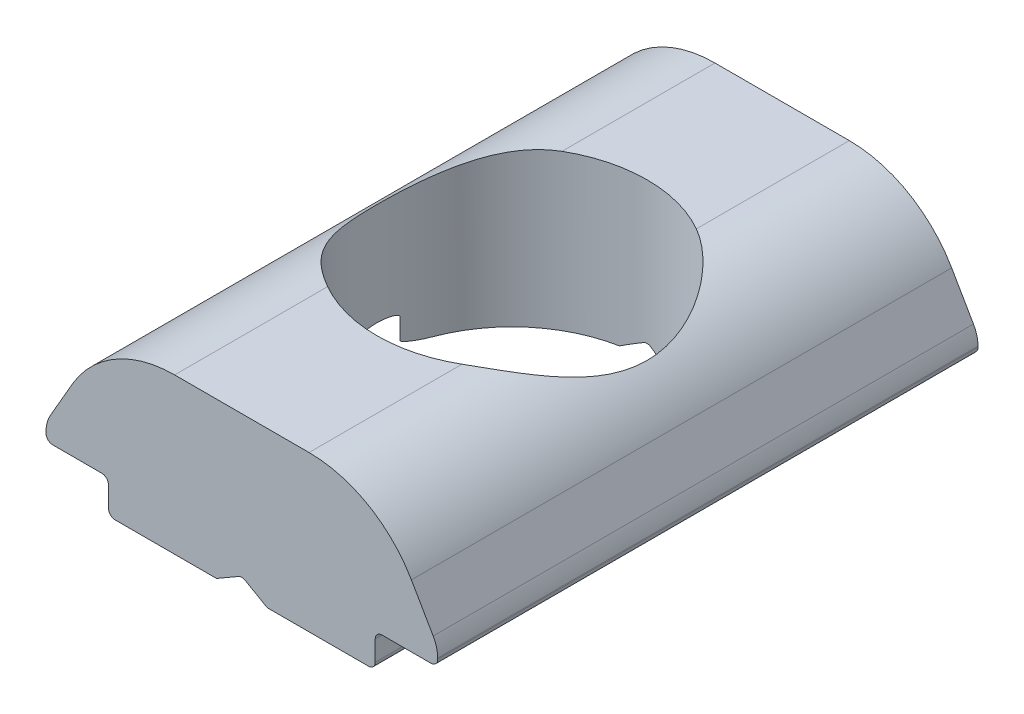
ISO-10303-21;
HEADER;
FILE_DESCRIPTION(('STEP AP214'),'2;1');
FILE_NAME('part.step','',(''),(''),'','','');
FILE_SCHEMA(('AUTOMOTIVE_DESIGN { 1 0 10303 214 1 1 1 1 }'));
ENDSEC;
DATA;
#1=APPLICATION_CONTEXT('core data for automotive mechanical design processes');
#2=APPLICATION_PROTOCOL_DEFINITION('international standard','automotive_design',2000,#1);
#3=PRODUCT_CONTEXT('',#1,'mechanical');
#4=PRODUCT('Part','Part','',(#3));
#5=PRODUCT_RELATED_PRODUCT_CATEGORY('part','',(#4));
#6=PRODUCT_DEFINITION_FORMATION('','',#4);
#7=PRODUCT_DEFINITION_CONTEXT('part definition',#1,'design');
#8=PRODUCT_DEFINITION('design','',#6,#7);
#9=PRODUCT_DEFINITION_SHAPE('','',#8);
#10=(LENGTH_UNIT() NAMED_UNIT(*) SI_UNIT(.MILLI.,.METRE.));
#11=(NAMED_UNIT(*) PLANE_ANGLE_UNIT() SI_UNIT($,.RADIAN.));
#12=(NAMED_UNIT(*) SI_UNIT($,.STERADIAN.) SOLID_ANGLE_UNIT());
#13=UNCERTAINTY_MEASURE_WITH_UNIT(LENGTH_MEASURE(1.E-05),#10,'distance_accuracy_value','');
#14=(GEOMETRIC_REPRESENTATION_CONTEXT(3) GLOBAL_UNCERTAINTY_ASSIGNED_CONTEXT((#13)) GLOBAL_UNIT_ASSIGNED_CONTEXT((#10,
#11,#12)) REPRESENTATION_CONTEXT('',''));
#15=CARTESIAN_POINT('',(0.,0.,0.));
#16=DIRECTION('',(0.,0.,1.));
#17=DIRECTION('',(1.,0.,0.));
#18=AXIS2_PLACEMENT_3D('',#15,#16,#17);
#19=CARTESIAN_POINT('',(4.15000107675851,17.4999999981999,14.5000000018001));
#20=DIRECTION('',(0.,-1.,0.));
#21=DIRECTION('',(0.,0.,-1.));
#22=AXIS2_PLACEMENT_3D('',#19,#20,#21);
#23=PLANE('',#22);
#24=DIRECTION('',(1.,0.,0.));
#25=VECTOR('',#24,1.);
#26=CARTESIAN_POINT('',(4.15000107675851,17.4999999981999,14.5000000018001));
#27=LINE('',#26,#25);
#28=CARTESIAN_POINT('',(5.60000107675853,17.4999999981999,14.5000000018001));
#29=VERTEX_POINT('',#28);
#30=CARTESIAN_POINT('',(4.15000107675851,17.4999999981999,14.5000000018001));
#31=VERTEX_POINT('',#30);
#32=EDGE_CURVE('E265',#29,#31,#27,.F.);
#33=ORIENTED_EDGE('',*,*,#32,.T.);
#34=DIRECTION('',(0.,0.,1.));
#35=VECTOR('',#34,1.);
#36=CARTESIAN_POINT('',(4.15000107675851,17.4999999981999,14.5000000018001));
#37=LINE('',#36,#35);
#38=CARTESIAN_POINT('',(4.15000107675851,17.4999999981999,-1.49999999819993));
#39=VERTEX_POINT('',#38);
#40=EDGE_CURVE('E260',#31,#39,#37,.F.);
#41=ORIENTED_EDGE('',*,*,#40,.T.);
#42=DIRECTION('',(1.,0.,0.));
#43=VECTOR('',#42,1.);
#44=CARTESIAN_POINT('',(4.15000107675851,17.4999999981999,-1.49999999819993));
#45=LINE('',#44,#43);
#46=CARTESIAN_POINT('',(5.60000107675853,17.4999999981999,-1.49999999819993));
#47=VERTEX_POINT('',#46);
#48=EDGE_CURVE('E256',#39,#47,#45,.T.);
#49=ORIENTED_EDGE('',*,*,#48,.T.);
#50=DIRECTION('',(0.,0.,1.));
#51=VECTOR('',#50,1.);
#52=CARTESIAN_POINT('',(5.60000107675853,17.4999999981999,14.5000000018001));
#53=LINE('',#52,#51);
#54=EDGE_CURVE('E258',#29,#47,#53,.F.);
#55=ORIENTED_EDGE('',*,*,#54,.F.);
#56=EDGE_LOOP('',(#33,#41,#49,#55));
#57=FACE_BOUND('',#56,.T.);
#58=ADVANCED_FACE('F16',(#57),#23,.T.);
#59=CARTESIAN_POINT('',(-5.59999892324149,17.4999999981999,14.5000000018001));
#60=DIRECTION('',(0.,-1.,0.));
#61=DIRECTION('',(0.,0.,-1.));
#62=AXIS2_PLACEMENT_3D('',#59,#60,#61);
#63=PLANE('',#62);
#64=DIRECTION('',(1.,0.,0.));
#65=VECTOR('',#64,1.);
#66=CARTESIAN_POINT('',(-5.59999892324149,17.4999999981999,14.5000000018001));
#67=LINE('',#66,#65);
#68=CARTESIAN_POINT('',(-4.14999892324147,17.4999999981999,14.5000000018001));
#69=VERTEX_POINT('',#68);
#70=CARTESIAN_POINT('',(-5.59999892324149,17.4999999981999,14.5000000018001));
#71=VERTEX_POINT('',#70);
#72=EDGE_CURVE('E282',#69,#71,#67,.F.);
#73=ORIENTED_EDGE('',*,*,#72,.T.);
#74=DIRECTION('',(0.,0.,1.));
#75=VECTOR('',#74,1.);
#76=CARTESIAN_POINT('',(-5.59999892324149,17.4999999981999,14.5000000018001));
#77=LINE('',#76,#75);
#78=CARTESIAN_POINT('',(-5.59999892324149,17.4999999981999,-1.49999999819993));
#79=VERTEX_POINT('',#78);
#80=EDGE_CURVE('E298',#79,#71,#77,.T.);
#81=ORIENTED_EDGE('',*,*,#80,.F.);
#82=DIRECTION('',(1.,0.,0.));
#83=VECTOR('',#82,1.);
#84=CARTESIAN_POINT('',(-5.59999892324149,17.4999999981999,-1.49999999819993));
#85=LINE('',#84,#83);
#86=CARTESIAN_POINT('',(-4.14999892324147,17.4999999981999,-1.49999999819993));
#87=VERTEX_POINT('',#86);
#88=EDGE_CURVE('E283',#79,#87,#85,.T.);
#89=ORIENTED_EDGE('',*,*,#88,.T.);
#90=DIRECTION('',(0.,0.,1.));
#91=VECTOR('',#90,1.);
#92=CARTESIAN_POINT('',(-4.14999892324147,17.4999999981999,14.5000000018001));
#93=LINE('',#92,#91);
#94=EDGE_CURVE('E291',#87,#69,#93,.T.);
#95=ORIENTED_EDGE('',*,*,#94,.T.);
#96=EDGE_LOOP('',(#73,#81,#89,#95));
#97=FACE_BOUND('',#96,.T.);
#98=ADVANCED_FACE('F546',(#97),#63,.T.);
#99=CARTESIAN_POINT('',(5.60000107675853,17.6999999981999,14.5000000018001));
#100=DIRECTION('',(0.,0.,1.));
#101=DIRECTION('',(1.,0.,0.));
#102=AXIS2_PLACEMENT_3D('',#99,#100,#101);
#103=CYLINDRICAL_SURFACE('',#102,0.200000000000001);
#104=CARTESIAN_POINT('',(5.60000107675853,17.6999999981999,14.5000000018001));
#105=DIRECTION('',(0.,0.,1.));
#106=DIRECTION('',(1.,0.,0.));
#107=AXIS2_PLACEMENT_3D('',#104,#105,#106);
#108=CIRCLE('',#107,0.200000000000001);
#109=CARTESIAN_POINT('',(5.80000107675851,17.6999999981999,14.5000000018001));
#110=VERTEX_POINT('',#109);
#111=EDGE_CURVE('E273',#110,#29,#108,.F.);
#112=ORIENTED_EDGE('',*,*,#111,.T.);
#113=ORIENTED_EDGE('',*,*,#54,.T.);
#114=CARTESIAN_POINT('',(5.60000107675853,17.6999999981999,-1.49999999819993));
#115=DIRECTION('',(0.,0.,1.));
#116=DIRECTION('',(1.,0.,0.));
#117=AXIS2_PLACEMENT_3D('',#114,#115,#116);
#118=CIRCLE('',#117,0.200000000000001);
#119=CARTESIAN_POINT('',(5.80000107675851,17.6999999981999,-1.49999999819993));
#120=VERTEX_POINT('',#119);
#121=EDGE_CURVE('E19',#47,#120,#118,.T.);
#122=ORIENTED_EDGE('',*,*,#121,.T.);
#123=DIRECTION('',(0.,0.,-1.));
#124=VECTOR('',#123,1.);
#125=CARTESIAN_POINT('',(5.80000107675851,17.6999999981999,14.5000000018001));
#126=LINE('',#125,#124);
#127=EDGE_CURVE('E586',#110,#120,#126,.T.);
#128=ORIENTED_EDGE('',*,*,#127,.F.);
#129=EDGE_LOOP('',(#112,#113,#122,#128));
#130=FACE_BOUND('',#129,.T.);
#131=ADVANCED_FACE('F269',(#130),#103,.T.);
#132=CARTESIAN_POINT('',(-5.59999892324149,17.6999999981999,14.5000000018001));
#133=DIRECTION('',(0.,0.,1.));
#134=DIRECTION('',(1.,0.,0.));
#135=AXIS2_PLACEMENT_3D('',#132,#133,#134);
#136=CYLINDRICAL_SURFACE('',#135,0.200000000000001);
#137=CARTESIAN_POINT('',(-5.59999892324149,17.6999999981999,14.5000000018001));
#138=DIRECTION('',(0.,0.,1.));
#139=DIRECTION('',(1.,0.,0.));
#140=AXIS2_PLACEMENT_3D('',#137,#138,#139);
#141=CIRCLE('',#140,0.200000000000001);
#142=CARTESIAN_POINT('',(-5.79999892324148,17.6999999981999,14.5000000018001));
#143=VERTEX_POINT('',#142);
#144=EDGE_CURVE('E299',#71,#143,#141,.F.);
#145=ORIENTED_EDGE('',*,*,#144,.T.);
#146=DIRECTION('',(0.,0.,1.));
#147=VECTOR('',#146,1.);
#148=CARTESIAN_POINT('',(-5.79999892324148,17.6999999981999,14.5000000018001));
#149=LINE('',#148,#147);
#150=CARTESIAN_POINT('',(-5.79999892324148,17.6999999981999,-1.49999999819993));
#151=VERTEX_POINT('',#150);
#152=EDGE_CURVE('E583',#151,#143,#149,.T.);
#153=ORIENTED_EDGE('',*,*,#152,.F.);
#154=CARTESIAN_POINT('',(-5.59999892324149,17.6999999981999,-1.49999999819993));
#155=DIRECTION('',(0.,0.,1.));
#156=DIRECTION('',(1.,0.,0.));
#157=AXIS2_PLACEMENT_3D('',#154,#155,#156);
#158=CIRCLE('',#157,0.200000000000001);
#159=EDGE_CURVE('E275',#151,#79,#158,.T.);
#160=ORIENTED_EDGE('',*,*,#159,.T.);
#161=ORIENTED_EDGE('',*,*,#80,.T.);
#162=EDGE_LOOP('',(#145,#153,#160,#161));
#163=FACE_BOUND('',#162,.T.);
#164=ADVANCED_FACE('F516',(#163),#136,.T.);
#165=CARTESIAN_POINT('',(4.15000107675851,17.2999999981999,14.5000000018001));
#166=DIRECTION('',(0.,0.,1.));
#167=DIRECTION('',(1.,0.,0.));
#168=AXIS2_PLACEMENT_3D('',#165,#166,#167);
#169=CYLINDRICAL_SURFACE('',#168,0.2);
#170=CARTESIAN_POINT('',(3.95000107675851,17.2999999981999,5.86952399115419));
#171=CARTESIAN_POINT('',(3.95000011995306,17.3019713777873,5.86951824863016));
#172=CARTESIAN_POINT('',(3.95003018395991,17.3039347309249,5.86970633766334));
#173=CARTESIAN_POINT('',(3.95014334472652,17.307773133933,5.8704157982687));
#174=CARTESIAN_POINT('',(3.95022573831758,17.3096490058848,5.87093275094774));
#175=CARTESIAN_POINT('',(3.95046499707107,17.3138178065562,5.87243685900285));
#176=CARTESIAN_POINT('',(3.95063645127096,17.3160758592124,5.87351639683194));
#177=CARTESIAN_POINT('',(3.95103217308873,17.3203987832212,5.8760169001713));
#178=CARTESIAN_POINT('',(3.95125674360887,17.3224624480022,5.87743982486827));
#179=CARTESIAN_POINT('',(3.95192273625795,17.3278771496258,5.88167767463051));
#180=CARTESIAN_POINT('',(3.95240034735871,17.3310309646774,5.88473540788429));
#181=CARTESIAN_POINT('',(3.95340849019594,17.3368780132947,5.89124634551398));
#182=CARTESIAN_POINT('',(3.95393913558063,17.3395702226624,5.89470040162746));
#183=CARTESIAN_POINT('',(3.95613192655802,17.3497830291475,5.90911359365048));
#184=CARTESIAN_POINT('',(3.95789224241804,17.3559391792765,5.92099749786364));
#185=CARTESIAN_POINT('',(3.96139075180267,17.3667510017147,5.94542805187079));
#186=CARTESIAN_POINT('',(3.9631286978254,17.3713956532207,5.95797882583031));
#187=CARTESIAN_POINT('',(3.96818373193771,17.3838155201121,5.99585238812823));
#188=CARTESIAN_POINT('',(3.97138096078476,17.3902035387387,6.02164902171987));
#189=CARTESIAN_POINT('',(3.97730795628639,17.4010528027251,6.0737080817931));
#190=CARTESIAN_POINT('',(3.98003640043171,17.4055086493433,6.09997160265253));
#191=CARTESIAN_POINT('',(3.98498905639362,17.4131019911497,6.15276420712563));
#192=CARTESIAN_POINT('',(3.98721280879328,17.4162382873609,6.17929350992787));
#193=CARTESIAN_POINT('',(3.99113214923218,17.4215360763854,6.23244966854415));
#194=CARTESIAN_POINT('',(3.99282836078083,17.4236987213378,6.25907637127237));
#195=CARTESIAN_POINT('',(3.99617645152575,17.4278597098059,6.32149686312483));
#196=CARTESIAN_POINT('',(3.99761625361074,17.4295509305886,6.3573225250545));
#197=CARTESIAN_POINT('',(3.99952557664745,17.4317451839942,6.42876856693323));
#198=CARTESIAN_POINT('',(4.0000022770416,17.4322570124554,6.46438847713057));
#199=CARTESIAN_POINT('',(4.0000010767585,17.4322875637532,6.50000000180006));
#200=B_SPLINE_CURVE_WITH_KNOTS('',3,(#170,#171,#172,#173,#174,#175,#176,#177,#178,#179,#180,
#181,#182,#183,#184,#185,#186,#187,#188,#189,#190,#191,#192,#193,#194,#195,#196,#197,#198,#199),
.UNSPECIFIED.,.F.,.F.,(4,2,2,2,2,2,2,2,2,2,2,2,2,2,4),(0.,0.00589202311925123,
0.0117065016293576,0.0191902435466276,0.0267177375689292,0.0398989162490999,0.0531089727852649,
0.0932899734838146,0.133757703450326,0.213846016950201,0.294156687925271,0.374540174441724,
0.454828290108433,0.562476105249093,0.669318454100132),.UNSPECIFIED.);
#201=CARTESIAN_POINT('',(3.95000107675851,17.2999999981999,5.86952399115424));
#202=VERTEX_POINT('',#201);
#203=CARTESIAN_POINT('',(4.0000010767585,17.4322875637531,6.50000000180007));
#204=VERTEX_POINT('',#203);
#205=EDGE_CURVE('E521',#202,#204,#200,.T.);
#206=ORIENTED_EDGE('',*,*,#205,.F.);
#207=DIRECTION('',(0.,0.,-1.));
#208=VECTOR('',#207,1.);
#209=CARTESIAN_POINT('',(3.95000107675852,17.2999999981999,14.5000000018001));
#210=LINE('',#209,#208);
#211=CARTESIAN_POINT('',(3.95000107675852,17.2999999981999,-1.49999999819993));
#212=VERTEX_POINT('',#211);
#213=EDGE_CURVE('E567',#212,#202,#210,.F.);
#214=ORIENTED_EDGE('',*,*,#213,.F.);
#215=CARTESIAN_POINT('',(4.15000107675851,17.2999999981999,-1.49999999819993));
#216=DIRECTION('',(0.,0.,1.));
#217=DIRECTION('',(1.,0.,0.));
#218=AXIS2_PLACEMENT_3D('',#215,#216,#217);
#219=CIRCLE('',#218,0.2);
#220=EDGE_CURVE('E294',#39,#212,#219,.T.);
#221=ORIENTED_EDGE('',*,*,#220,.F.);
#222=ORIENTED_EDGE('',*,*,#40,.F.);
#223=CARTESIAN_POINT('',(4.15000107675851,17.2999999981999,14.5000000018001));
#224=DIRECTION('',(0.,0.,1.));
#225=DIRECTION('',(1.,0.,0.));
#226=AXIS2_PLACEMENT_3D('',#223,#224,#225);
#227=CIRCLE('',#226,0.2);
#228=CARTESIAN_POINT('',(3.95000107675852,17.2999999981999,14.5000000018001));
#229=VERTEX_POINT('',#228);
#230=EDGE_CURVE('E295',#229,#31,#227,.F.);
#231=ORIENTED_EDGE('',*,*,#230,.F.);
#232=DIRECTION('',(0.,0.,-1.));
#233=VECTOR('',#232,1.);
#234=CARTESIAN_POINT('',(3.95000107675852,17.2999999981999,14.5000000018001));
#235=LINE('',#234,#233);
#236=CARTESIAN_POINT('',(3.95000107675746,17.299999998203,7.13047601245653));
#237=VERTEX_POINT('',#236);
#238=EDGE_CURVE('E571',#237,#229,#235,.F.);
#239=ORIENTED_EDGE('',*,*,#238,.F.);
#240=CARTESIAN_POINT('',(4.0000010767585,17.4322875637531,6.50000000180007));
#241=CARTESIAN_POINT('',(4.00000190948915,17.4322650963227,6.53337835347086));
#242=CARTESIAN_POINT('',(3.99958332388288,17.4318119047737,6.56676173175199));
#243=CARTESIAN_POINT('',(3.99791088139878,17.429892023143,6.63354024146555));
#244=CARTESIAN_POINT('',(3.99665546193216,17.4284234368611,6.66693527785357));
#245=CARTESIAN_POINT('',(3.99330536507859,17.4243103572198,6.73376464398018));
#246=CARTESIAN_POINT('',(3.99120690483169,17.4216605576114,6.76719846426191));
#247=CARTESIAN_POINT('',(3.9861860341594,17.4148205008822,6.83383087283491));
#248=CARTESIAN_POINT('',(3.98326434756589,17.4106315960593,6.86702964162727));
#249=CARTESIAN_POINT('',(3.97859201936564,17.403078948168,6.91352045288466));
#250=CARTESIAN_POINT('',(3.97716732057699,17.4006861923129,6.92700249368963));
#251=CARTESIAN_POINT('',(3.97419291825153,17.395397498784,6.95385198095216));
#252=CARTESIAN_POINT('',(3.97264323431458,17.3925016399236,6.96721944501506));
#253=CARTESIAN_POINT('',(3.96880508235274,17.3848159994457,6.99893749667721));
#254=CARTESIAN_POINT('',(3.96646294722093,17.3797270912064,7.01721280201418));
#255=CARTESIAN_POINT('',(3.96234250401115,17.3693249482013,7.04773236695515));
#256=CARTESIAN_POINT('',(3.9606046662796,17.3645324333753,7.06014803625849));
#257=CARTESIAN_POINT('',(3.95792494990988,17.3558275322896,7.078690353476));
#258=CARTESIAN_POINT('',(3.95698263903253,17.3525154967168,7.08509568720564));
#259=CARTESIAN_POINT('',(3.95513142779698,17.3451719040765,7.09747992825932));
#260=CARTESIAN_POINT('',(3.95422240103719,17.3411435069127,7.10346055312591));
#261=CARTESIAN_POINT('',(3.95303291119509,17.3347395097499,7.1111827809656));
#262=CARTESIAN_POINT('',(3.95270436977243,17.3328348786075,7.11330326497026));
#263=CARTESIAN_POINT('',(3.95207556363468,17.3288043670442,7.11734219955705));
#264=CARTESIAN_POINT('',(3.95177536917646,17.3266779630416,7.11926014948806));
#265=CARTESIAN_POINT('',(3.95121622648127,17.3221341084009,7.1228179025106));
#266=CARTESIAN_POINT('',(3.95095805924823,17.3197123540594,7.12445246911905));
#267=CARTESIAN_POINT('',(3.95051870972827,17.3146026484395,7.12722596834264));
#268=CARTESIAN_POINT('',(3.95033694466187,17.3119169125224,7.12836865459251));
#269=CARTESIAN_POINT('',(3.95014220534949,17.3076558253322,7.12959134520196));
#270=CARTESIAN_POINT('',(3.9500900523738,17.3061525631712,7.12991838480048));
#271=CARTESIAN_POINT('',(3.95001914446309,17.3031007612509,7.13036281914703));
#272=CARTESIAN_POINT('',(3.950000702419,17.301551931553,7.13047824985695));
#273=CARTESIAN_POINT('',(3.9500010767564,17.2999999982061,7.13047601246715));
#274=B_SPLINE_CURVE_WITH_KNOTS('',3,(#240,#241,#242,#243,#244,#245,#246,#247,#248,#249,#250,
#251,#252,#253,#254,#255,#256,#257,#258,#259,#260,#261,#262,#263,#264,#265,#266,#267,#268,#269,
#270,#271,#272,#273),.UNSPECIFIED.,.F.,.F.,(4,2,2,2,2,2,2,2,2,2,2,2,2,2,2,2,4),(0.,
0.100137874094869,0.200463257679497,0.301243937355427,0.401936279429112,0.443228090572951,
0.484513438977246,0.541789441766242,0.581962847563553,0.603757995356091,0.625459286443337,
0.634055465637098,0.642672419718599,0.651434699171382,0.660128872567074,0.664732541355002,
0.669378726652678),.UNSPECIFIED.);
#275=EDGE_CURVE('E527',#204,#237,#274,.T.);
#276=ORIENTED_EDGE('',*,*,#275,.F.);
#277=EDGE_LOOP('',(#206,#214,#221,#222,#231,#239,#276));
#278=FACE_BOUND('',#277,.T.);
#279=ADVANCED_FACE('F509',(#278),#169,.F.);
#280=CARTESIAN_POINT('',(-4.14999892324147,17.2999999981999,14.5000000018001));
#281=DIRECTION('',(0.,0.,1.));
#282=DIRECTION('',(1.,0.,0.));
#283=AXIS2_PLACEMENT_3D('',#280,#281,#282);
#284=CYLINDRICAL_SURFACE('',#283,0.2);
#285=CARTESIAN_POINT('',(-3.94999892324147,17.2999999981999,7.13047601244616));
#286=CARTESIAN_POINT('',(-3.94999796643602,17.3019713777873,7.13048175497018));
#287=CARTESIAN_POINT('',(-3.95002803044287,17.3039347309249,7.130293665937));
#288=CARTESIAN_POINT('',(-3.95014119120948,17.307773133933,7.12958420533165));
#289=CARTESIAN_POINT('',(-3.95022358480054,17.3096490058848,7.12906725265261));
#290=CARTESIAN_POINT('',(-3.95046284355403,17.3138178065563,7.1275631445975));
#291=CARTESIAN_POINT('',(-3.95063429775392,17.3160758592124,7.1264836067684));
#292=CARTESIAN_POINT('',(-3.95103001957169,17.3203987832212,7.12398310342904));
#293=CARTESIAN_POINT('',(-3.95125459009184,17.3224624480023,7.12256017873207));
#294=CARTESIAN_POINT('',(-3.95192058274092,17.3278771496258,7.11832232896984));
#295=CARTESIAN_POINT('',(-3.95239819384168,17.3310309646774,7.11526459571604));
#296=CARTESIAN_POINT('',(-3.9534063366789,17.3368780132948,7.10875365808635));
#297=CARTESIAN_POINT('',(-3.95393698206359,17.3395702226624,7.10529960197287));
#298=CARTESIAN_POINT('',(-3.95612977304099,17.3497830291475,7.09088640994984));
#299=CARTESIAN_POINT('',(-3.95789008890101,17.3559391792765,7.07900250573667));
#300=CARTESIAN_POINT('',(-3.96138859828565,17.3667510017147,7.0545719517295));
#301=CARTESIAN_POINT('',(-3.96312654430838,17.3713956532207,7.04202117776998));
#302=CARTESIAN_POINT('',(-3.96818157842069,17.3838155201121,7.00414761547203));
#303=CARTESIAN_POINT('',(-3.97137880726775,17.3902035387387,6.97835098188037));
#304=CARTESIAN_POINT('',(-3.97730580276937,17.4010528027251,6.92629192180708));
#305=CARTESIAN_POINT('',(-3.9800342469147,17.4055086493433,6.90002840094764));
#306=CARTESIAN_POINT('',(-3.98498690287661,17.4131019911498,6.8472357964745));
#307=CARTESIAN_POINT('',(-3.98721065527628,17.4162382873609,6.82070649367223));
#308=CARTESIAN_POINT('',(-3.99112999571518,17.4215360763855,6.7675503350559));
#309=CARTESIAN_POINT('',(-3.99282620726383,17.4236987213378,6.74092363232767));
#310=CARTESIAN_POINT('',(-3.99617429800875,17.4278597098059,6.67850314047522));
#311=CARTESIAN_POINT('',(-3.99761410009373,17.4295509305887,6.64267747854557));
#312=CARTESIAN_POINT('',(-3.99952342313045,17.4317451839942,6.57123143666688));
#313=CARTESIAN_POINT('',(-4.0000001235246,17.4322570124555,6.53561152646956));
#314=CARTESIAN_POINT('',(-3.9999989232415,17.4322875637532,6.5000000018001));
#315=B_SPLINE_CURVE_WITH_KNOTS('',3,(#285,#286,#287,#288,#289,#290,#291,#292,#293,#294,#295,
#296,#297,#298,#299,#300,#301,#302,#303,#304,#305,#306,#307,#308,#309,#310,#311,#312,#313,#314),
.UNSPECIFIED.,.F.,.F.,(4,2,2,2,2,2,2,2,2,2,2,2,2,2,4),(0.,0.00589202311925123,0.011706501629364,
0.0191902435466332,0.0267177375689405,0.0398989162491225,0.0531089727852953,0.0932899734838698,
0.133757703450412,0.213846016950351,0.294156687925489,0.374540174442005,0.454828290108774,
0.562476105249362,0.669318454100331),.UNSPECIFIED.);
#316=CARTESIAN_POINT('',(-3.94999892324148,17.2999999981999,7.13047601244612));
#317=VERTEX_POINT('',#316);
#318=CARTESIAN_POINT('',(-3.9999989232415,17.4322875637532,6.50000000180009));
#319=VERTEX_POINT('',#318);
#320=EDGE_CURVE('E498',#317,#319,#315,.T.);
#321=ORIENTED_EDGE('',*,*,#320,.F.);
#322=DIRECTION('',(0.,0.,1.));
#323=VECTOR('',#322,1.);
#324=CARTESIAN_POINT('',(-3.94999892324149,17.2999999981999,14.5000000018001));
#325=LINE('',#324,#323);
#326=CARTESIAN_POINT('',(-3.94999892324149,17.2999999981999,14.5000000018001));
#327=VERTEX_POINT('',#326);
#328=EDGE_CURVE('E572',#327,#317,#325,.F.);
#329=ORIENTED_EDGE('',*,*,#328,.F.);
#330=CARTESIAN_POINT('',(-4.14999892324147,17.2999999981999,14.5000000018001));
#331=DIRECTION('',(0.,0.,1.));
#332=DIRECTION('',(1.,0.,0.));
#333=AXIS2_PLACEMENT_3D('',#330,#331,#332);
#334=CIRCLE('',#333,0.2);
#335=EDGE_CURVE('E535',#69,#327,#334,.F.);
#336=ORIENTED_EDGE('',*,*,#335,.F.);
#337=ORIENTED_EDGE('',*,*,#94,.F.);
#338=CARTESIAN_POINT('',(-4.14999892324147,17.2999999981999,-1.49999999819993));
#339=DIRECTION('',(0.,0.,1.));
#340=DIRECTION('',(1.,0.,0.));
#341=AXIS2_PLACEMENT_3D('',#338,#339,#340);
#342=CIRCLE('',#341,0.2);
#343=CARTESIAN_POINT('',(-3.94999892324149,17.2999999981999,-1.49999999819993));
#344=VERTEX_POINT('',#343);
#345=EDGE_CURVE('E533',#344,#87,#342,.T.);
#346=ORIENTED_EDGE('',*,*,#345,.F.);
#347=DIRECTION('',(0.,0.,1.));
#348=VECTOR('',#347,1.);
#349=CARTESIAN_POINT('',(-3.94999892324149,17.2999999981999,14.5000000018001));
#350=LINE('',#349,#348);
#351=CARTESIAN_POINT('',(-3.94999892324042,17.299999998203,5.86952399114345));
#352=VERTEX_POINT('',#351);
#353=EDGE_CURVE('E557',#352,#344,#350,.F.);
#354=ORIENTED_EDGE('',*,*,#353,.F.);
#355=CARTESIAN_POINT('',(-3.9999989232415,17.4322875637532,6.50000000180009));
#356=CARTESIAN_POINT('',(-3.99999975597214,17.4322650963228,6.4666216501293));
#357=CARTESIAN_POINT('',(-3.99958117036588,17.4318119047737,6.43323827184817));
#358=CARTESIAN_POINT('',(-3.99790872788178,17.4298920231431,6.36645976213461));
#359=CARTESIAN_POINT('',(-3.99665330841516,17.4284234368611,6.33306472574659));
#360=CARTESIAN_POINT('',(-3.99330321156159,17.4243103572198,6.26623535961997));
#361=CARTESIAN_POINT('',(-3.99120475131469,17.4216605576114,6.23280153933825));
#362=CARTESIAN_POINT('',(-3.9861838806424,17.4148205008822,6.16616913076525));
#363=CARTESIAN_POINT('',(-3.98326219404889,17.4106315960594,6.13297036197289));
#364=CARTESIAN_POINT('',(-3.97858986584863,17.4030789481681,6.08647955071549));
#365=CARTESIAN_POINT('',(-3.97716516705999,17.400686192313,6.0729975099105));
#366=CARTESIAN_POINT('',(-3.97419076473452,17.395397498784,6.04614802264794));
#367=CARTESIAN_POINT('',(-3.97264108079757,17.3925016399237,6.03278055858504));
#368=CARTESIAN_POINT('',(-3.96880292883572,17.3848159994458,6.00106250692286));
#369=CARTESIAN_POINT('',(-3.96646079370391,17.3797270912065,5.98278720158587));
#370=CARTESIAN_POINT('',(-3.96234035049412,17.3693249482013,5.95226763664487));
#371=CARTESIAN_POINT('',(-3.96060251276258,17.3645324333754,5.93985196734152));
#372=CARTESIAN_POINT('',(-3.95792279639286,17.3558275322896,5.921309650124));
#373=CARTESIAN_POINT('',(-3.9569804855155,17.3525154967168,5.91490431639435));
#374=CARTESIAN_POINT('',(-3.95512927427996,17.3451719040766,5.90252007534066));
#375=CARTESIAN_POINT('',(-3.95422024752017,17.3411435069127,5.89653945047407));
#376=CARTESIAN_POINT('',(-3.95303075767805,17.33473950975,5.88881722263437));
#377=CARTESIAN_POINT('',(-3.9527022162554,17.3328348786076,5.88669673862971));
#378=CARTESIAN_POINT('',(-3.95207341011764,17.3288043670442,5.88265780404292));
#379=CARTESIAN_POINT('',(-3.95177321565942,17.3266779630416,5.8807398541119));
#380=CARTESIAN_POINT('',(-3.95121407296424,17.3221341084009,5.87718210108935));
#381=CARTESIAN_POINT('',(-3.95095590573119,17.3197123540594,5.87554753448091));
#382=CARTESIAN_POINT('',(-3.95051655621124,17.3146026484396,5.87277403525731));
#383=CARTESIAN_POINT('',(-3.95033479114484,17.3119169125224,5.87163134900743));
#384=CARTESIAN_POINT('',(-3.95014005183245,17.3076558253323,5.87040865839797));
#385=CARTESIAN_POINT('',(-3.95008789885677,17.3061525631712,5.87008161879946));
#386=CARTESIAN_POINT('',(-3.95001699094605,17.3031007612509,5.8696371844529));
#387=CARTESIAN_POINT('',(-3.94999854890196,17.301551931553,5.86952175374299));
#388=CARTESIAN_POINT('',(-3.94999892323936,17.2999999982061,5.86952399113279));
#389=B_SPLINE_CURVE_WITH_KNOTS('',3,(#355,#356,#357,#358,#359,#360,#361,#362,#363,#364,#365,
#366,#367,#368,#369,#370,#371,#372,#373,#374,#375,#376,#377,#378,#379,#380,#381,#382,#383,#384,
#385,#386,#387,#388),.UNSPECIFIED.,.F.,.F.,(4,2,2,2,2,2,2,2,2,2,2,2,2,2,2,2,4),(0.,
0.100137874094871,0.200463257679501,0.301243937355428,0.40193627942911,0.443228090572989,
0.484513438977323,0.541789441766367,0.581962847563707,0.603757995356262,0.62545928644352,
0.634055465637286,0.642672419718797,0.651434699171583,0.660128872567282,0.664732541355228,
0.669378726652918),.UNSPECIFIED.);
#390=EDGE_CURVE('E491',#319,#352,#389,.T.);
#391=ORIENTED_EDGE('',*,*,#390,.F.);
#392=EDGE_LOOP('',(#321,#329,#336,#337,#346,#354,#391));
#393=FACE_BOUND('',#392,.T.);
#394=ADVANCED_FACE('F503',(#393),#284,.F.);
#395=CARTESIAN_POINT('',(5.80000107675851,17.6999999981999,14.5000000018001));
#396=DIRECTION('',(1.,0.,0.));
#397=DIRECTION('',(0.,0.,-1.));
#398=AXIS2_PLACEMENT_3D('',#395,#396,#397);
#399=PLANE('',#398);
#400=DIRECTION('',(0.,1.,0.));
#401=VECTOR('',#400,1.);
#402=CARTESIAN_POINT('',(5.80000107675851,17.6999999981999,14.5000000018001));
#403=LINE('',#402,#401);
#404=CARTESIAN_POINT('',(5.80000107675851,17.7320508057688,14.5000000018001));
#405=VERTEX_POINT('',#404);
#406=EDGE_CURVE('E587',#405,#110,#403,.F.);
#407=ORIENTED_EDGE('',*,*,#406,.T.);
#408=ORIENTED_EDGE('',*,*,#127,.T.);
#409=DIRECTION('',(0.,1.,0.));
#410=VECTOR('',#409,1.);
#411=CARTESIAN_POINT('',(5.80000107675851,17.6999999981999,-1.49999999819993));
#412=LINE('',#411,#410);
#413=CARTESIAN_POINT('',(5.80000107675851,17.7320508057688,-1.49999999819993));
#414=VERTEX_POINT('',#413);
#415=EDGE_CURVE('E281',#120,#414,#412,.T.);
#416=ORIENTED_EDGE('',*,*,#415,.T.);
#417=DIRECTION('',(0.,0.,1.));
#418=VECTOR('',#417,1.);
#419=CARTESIAN_POINT('',(5.8000010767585,17.7320508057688,14.5000000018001));
#420=LINE('',#419,#418);
#421=EDGE_CURVE('E444',#405,#414,#420,.F.);
#422=ORIENTED_EDGE('',*,*,#421,.F.);
#423=EDGE_LOOP('',(#407,#408,#416,#422));
#424=FACE_BOUND('',#423,.T.);
#425=ADVANCED_FACE('F508',(#424),#399,.T.);
#426=CARTESIAN_POINT('',(-5.79999892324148,17.7320508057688,14.5000000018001));
#427=DIRECTION('',(-1.,0.,0.));
#428=DIRECTION('',(0.,0.,1.));
#429=AXIS2_PLACEMENT_3D('',#426,#427,#428);
#430=PLANE('',#429);
#431=DIRECTION('',(0.,1.,0.));
#432=VECTOR('',#431,1.);
#433=CARTESIAN_POINT('',(-5.79999892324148,17.7320508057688,14.5000000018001));
#434=LINE('',#433,#432);
#435=CARTESIAN_POINT('',(-5.79999892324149,17.7320508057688,14.5000000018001));
#436=VERTEX_POINT('',#435);
#437=EDGE_CURVE('E579',#143,#436,#434,.T.);
#438=ORIENTED_EDGE('',*,*,#437,.T.);
#439=DIRECTION('',(0.,0.,1.));
#440=VECTOR('',#439,1.);
#441=CARTESIAN_POINT('',(-5.7999989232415,17.7320508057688,14.5000000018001));
#442=LINE('',#441,#440);
#443=CARTESIAN_POINT('',(-5.79999892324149,17.7320508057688,-1.49999999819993));
#444=VERTEX_POINT('',#443);
#445=EDGE_CURVE('E441',#444,#436,#442,.T.);
#446=ORIENTED_EDGE('',*,*,#445,.F.);
#447=DIRECTION('',(0.,1.,0.));
#448=VECTOR('',#447,1.);
#449=CARTESIAN_POINT('',(-5.79999892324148,17.7320508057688,-1.49999999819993));
#450=LINE('',#449,#448);
#451=EDGE_CURVE('E584',#444,#151,#450,.F.);
#452=ORIENTED_EDGE('',*,*,#451,.T.);
#453=ORIENTED_EDGE('',*,*,#152,.T.);
#454=EDGE_LOOP('',(#438,#446,#452,#453));
#455=FACE_BOUND('',#454,.T.);
#456=ADVANCED_FACE('F620',(#455),#430,.T.);
#457=CARTESIAN_POINT('',(-3.94999892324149,17.2999999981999,14.5000000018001));
#458=DIRECTION('',(-1.,0.,0.));
#459=DIRECTION('',(0.,0.,1.));
#460=AXIS2_PLACEMENT_3D('',#457,#458,#459);
#461=PLANE('',#460);
#462=DIRECTION('',(0.,1.,0.));
#463=VECTOR('',#462,1.);
#464=CARTESIAN_POINT('',(-3.94999892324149,17.2999999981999,14.5000000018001));
#465=LINE('',#464,#463);
#466=CARTESIAN_POINT('',(-3.94999892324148,16.6999999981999,14.5000000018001));
#467=VERTEX_POINT('',#466);
#468=EDGE_CURVE('E574',#467,#327,#465,.T.);
#469=ORIENTED_EDGE('',*,*,#468,.T.);
#470=ORIENTED_EDGE('',*,*,#328,.T.);
#471=DIRECTION('',(0.,1.,0.));
#472=VECTOR('',#471,1.);
#473=CARTESIAN_POINT('',(-3.94999892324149,17.2999999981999,7.13047601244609));
#474=LINE('',#473,#472);
#475=CARTESIAN_POINT('',(-3.94999892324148,16.6999999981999,7.13047601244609));
#476=VERTEX_POINT('',#475);
#477=EDGE_CURVE('E576',#317,#476,#474,.F.);
#478=ORIENTED_EDGE('',*,*,#477,.T.);
#479=DIRECTION('',(0.,0.,1.));
#480=VECTOR('',#479,1.);
#481=CARTESIAN_POINT('',(-3.94999892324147,16.6999999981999,14.5000000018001));
#482=LINE('',#481,#480);
#483=EDGE_CURVE('E428',#467,#476,#482,.F.);
#484=ORIENTED_EDGE('',*,*,#483,.F.);
#485=EDGE_LOOP('',(#469,#470,#478,#484));
#486=FACE_BOUND('',#485,.T.);
#487=ADVANCED_FACE('F833',(#486),#461,.T.);
#488=CARTESIAN_POINT('',(3.95000107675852,16.6999999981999,14.5000000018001));
#489=DIRECTION('',(1.,0.,0.));
#490=DIRECTION('',(0.,0.,-1.));
#491=AXIS2_PLACEMENT_3D('',#488,#489,#490);
#492=PLANE('',#491);
#493=DIRECTION('',(0.,1.,0.));
#494=VECTOR('',#493,1.);
#495=CARTESIAN_POINT('',(3.95000107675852,16.6999999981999,14.5000000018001));
#496=LINE('',#495,#494);
#497=CARTESIAN_POINT('',(3.95000107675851,16.6999999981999,14.5000000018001));
#498=VERTEX_POINT('',#497);
#499=EDGE_CURVE('E490',#229,#498,#496,.F.);
#500=ORIENTED_EDGE('',*,*,#499,.T.);
#501=DIRECTION('',(0.,0.,1.));
#502=VECTOR('',#501,1.);
#503=CARTESIAN_POINT('',(3.9500010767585,16.6999999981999,14.5000000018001));
#504=LINE('',#503,#502);
#505=CARTESIAN_POINT('',(3.95000107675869,16.6999999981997,7.13047601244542));
#506=VERTEX_POINT('',#505);
#507=EDGE_CURVE('E427',#506,#498,#504,.T.);
#508=ORIENTED_EDGE('',*,*,#507,.F.);
#509=DIRECTION('',(0.,1.,0.));
#510=VECTOR('',#509,1.);
#511=CARTESIAN_POINT('',(3.95000107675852,16.6999999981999,7.13047601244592));
#512=LINE('',#511,#510);
#513=EDGE_CURVE('E569',#506,#237,#512,.T.);
#514=ORIENTED_EDGE('',*,*,#513,.T.);
#515=ORIENTED_EDGE('',*,*,#238,.T.);
#516=EDGE_LOOP('',(#500,#508,#514,#515));
#517=FACE_BOUND('',#516,.T.);
#518=ADVANCED_FACE('F478',(#517),#492,.T.);
#519=CARTESIAN_POINT('',(1.076758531E-06,16.7020725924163,14.5000000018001));
#520=DIRECTION('',(0.,0.,1.));
#521=DIRECTION('',(1.,0.,0.));
#522=AXIS2_PLACEMENT_3D('',#519,#520,#521);
#523=CYLINDRICAL_SURFACE('',#522,0.2);
#524=DIRECTION('',(0.,0.,1.));
#525=VECTOR('',#524,1.);
#526=CARTESIAN_POINT('',(0.100001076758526,16.8752776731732,14.5000000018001));
#527=LINE('',#526,#525);
#528=CARTESIAN_POINT('',(0.100001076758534,16.8752776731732,14.5000000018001));
#529=VERTEX_POINT('',#528);
#530=CARTESIAN_POINT('',(0.100001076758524,16.8752776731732,10.4987498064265));
#531=VERTEX_POINT('',#530);
#532=EDGE_CURVE('E660',#529,#531,#527,.F.);
#533=ORIENTED_EDGE('',*,*,#532,.F.);
#534=CARTESIAN_POINT('',(1.076758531E-06,16.7020725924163,14.5000000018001));
#535=DIRECTION('',(0.,0.,1.));
#536=DIRECTION('',(1.,0.,0.));
#537=AXIS2_PLACEMENT_3D('',#534,#535,#536);
#538=CIRCLE('',#537,0.2);
#539=CARTESIAN_POINT('',(-0.0999989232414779,16.8752776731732,14.5000000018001));
#540=VERTEX_POINT('',#539);
#541=EDGE_CURVE('E488',#540,#529,#538,.F.);
#542=ORIENTED_EDGE('',*,*,#541,.F.);
#543=DIRECTION('',(0.,0.,1.));
#544=VECTOR('',#543,1.);
#545=CARTESIAN_POINT('',(-0.0999989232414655,16.8752776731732,14.5000000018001));
#546=LINE('',#545,#544);
#547=CARTESIAN_POINT('',(-0.0999989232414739,16.8752776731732,10.4987498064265));
#548=VERTEX_POINT('',#547);
#549=EDGE_CURVE('E436',#548,#540,#546,.T.);
#550=ORIENTED_EDGE('',*,*,#549,.F.);
#551=CARTESIAN_POINT('',(0.100001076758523,16.8752776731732,10.4987498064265));
#552=CARTESIAN_POINT('',(0.0902654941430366,16.8809094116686,10.4989947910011));
#553=CARTESIAN_POINT('',(0.0800481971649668,16.8857025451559,10.4992133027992));
#554=CARTESIAN_POINT('',(0.0589742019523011,16.8935071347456,10.4995786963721));
#555=CARTESIAN_POINT('',(0.0481187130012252,16.8965218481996,10.4997257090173));
#556=CARTESIAN_POINT('',(0.0260451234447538,16.900688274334,10.4999305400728));
#557=CARTESIAN_POINT('',(0.0148267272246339,16.9018384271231,10.499988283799));
#558=CARTESIAN_POINT('',(-0.00764581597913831,16.9022423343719,10.500008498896));
#559=CARTESIAN_POINT('',(-0.0188999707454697,16.9014956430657,10.4999709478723));
#560=CARTESIAN_POINT('',(-0.0422860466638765,16.8979434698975,10.4997951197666));
#561=CARTESIAN_POINT('',(-0.0543869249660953,16.8949311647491,10.4996467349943));
#562=CARTESIAN_POINT('',(-0.0778577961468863,16.8867200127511,10.4992601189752));
#563=CARTESIAN_POINT('',(-0.089225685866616,16.8815151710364,10.4990216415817));
#564=CARTESIAN_POINT('',(-0.0999989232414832,16.8752776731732,10.4987498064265));
#565=B_SPLINE_CURVE_WITH_KNOTS('',3,(#551,#552,#553,#554,#555,#556,#557,#558,#559,#560,#561,
#562,#563,#564),.UNSPECIFIED.,.F.,.F.,(4,2,2,2,2,2,4),(0.,0.0337047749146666,0.0673476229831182,
0.101018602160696,0.134697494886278,0.171892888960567,0.209190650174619),.UNSPECIFIED.);
#566=EDGE_CURVE('E481',#531,#548,#565,.T.);
#567=ORIENTED_EDGE('',*,*,#566,.F.);
#568=EDGE_LOOP('',(#533,#542,#550,#567));
#569=FACE_BOUND('',#568,.T.);
#570=ADVANCED_FACE('F473',(#569),#523,.F.);
#571=CARTESIAN_POINT('',(3.95000107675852,16.6999999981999,14.5000000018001));
#572=DIRECTION('',(1.,0.,0.));
#573=DIRECTION('',(0.,0.,-1.));
#574=AXIS2_PLACEMENT_3D('',#571,#572,#573);
#575=PLANE('',#574);
#576=DIRECTION('',(0.,1.,0.));
#577=VECTOR('',#576,1.);
#578=CARTESIAN_POINT('',(3.95000107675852,16.6999999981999,-1.49999999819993));
#579=LINE('',#578,#577);
#580=CARTESIAN_POINT('',(3.95000107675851,16.6999999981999,-1.49999999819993));
#581=VERTEX_POINT('',#580);
#582=EDGE_CURVE('E565',#581,#212,#579,.T.);
#583=ORIENTED_EDGE('',*,*,#582,.T.);
#584=ORIENTED_EDGE('',*,*,#213,.T.);
#585=DIRECTION('',(0.,1.,0.));
#586=VECTOR('',#585,1.);
#587=CARTESIAN_POINT('',(3.95000107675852,16.6999999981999,5.86952399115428));
#588=LINE('',#587,#586);
#589=CARTESIAN_POINT('',(3.95000107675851,16.6999999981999,5.86952399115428));
#590=VERTEX_POINT('',#589);
#591=EDGE_CURVE('E487',#202,#590,#588,.F.);
#592=ORIENTED_EDGE('',*,*,#591,.T.);
#593=DIRECTION('',(0.,0.,1.));
#594=VECTOR('',#593,1.);
#595=CARTESIAN_POINT('',(3.9500010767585,16.6999999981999,14.5000000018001));
#596=LINE('',#595,#594);
#597=EDGE_CURVE('E385',#581,#590,#596,.T.);
#598=ORIENTED_EDGE('',*,*,#597,.F.);
#599=EDGE_LOOP('',(#583,#584,#592,#598));
#600=FACE_BOUND('',#599,.T.);
#601=ADVANCED_FACE('F469',(#600),#575,.T.);
#602=CARTESIAN_POINT('',(-3.94999892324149,17.2999999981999,14.5000000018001));
#603=DIRECTION('',(-1.,0.,0.));
#604=DIRECTION('',(0.,0.,1.));
#605=AXIS2_PLACEMENT_3D('',#602,#603,#604);
#606=PLANE('',#605);
#607=DIRECTION('',(0.,1.,0.));
#608=VECTOR('',#607,1.);
#609=CARTESIAN_POINT('',(-3.94999892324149,17.2999999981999,-1.49999999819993));
#610=LINE('',#609,#608);
#611=CARTESIAN_POINT('',(-3.94999892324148,16.6999999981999,-1.49999999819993));
#612=VERTEX_POINT('',#611);
#613=EDGE_CURVE('E553',#344,#612,#610,.F.);
#614=ORIENTED_EDGE('',*,*,#613,.T.);
#615=DIRECTION('',(0.,0.,1.));
#616=VECTOR('',#615,1.);
#617=CARTESIAN_POINT('',(-3.94999892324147,16.6999999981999,14.5000000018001));
#618=LINE('',#617,#616);
#619=CARTESIAN_POINT('',(-3.94999892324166,16.6999999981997,5.86952399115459));
#620=VERTEX_POINT('',#619);
#621=EDGE_CURVE('E378',#620,#612,#618,.F.);
#622=ORIENTED_EDGE('',*,*,#621,.F.);
#623=DIRECTION('',(0.,1.,0.));
#624=VECTOR('',#623,1.);
#625=CARTESIAN_POINT('',(-3.94999892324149,17.2999999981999,5.86952399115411));
#626=LINE('',#625,#624);
#627=EDGE_CURVE('E560',#620,#352,#626,.T.);
#628=ORIENTED_EDGE('',*,*,#627,.T.);
#629=ORIENTED_EDGE('',*,*,#353,.T.);
#630=EDGE_LOOP('',(#614,#622,#628,#629));
#631=FACE_BOUND('',#630,.T.);
#632=ADVANCED_FACE('F464',(#631),#606,.T.);
#633=CARTESIAN_POINT('',(1.076758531E-06,16.7020725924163,14.5000000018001));
#634=DIRECTION('',(0.,0.,1.));
#635=DIRECTION('',(1.,0.,0.));
#636=AXIS2_PLACEMENT_3D('',#633,#634,#635);
#637=CYLINDRICAL_SURFACE('',#636,0.2);
#638=DIRECTION('',(0.,0.,1.));
#639=VECTOR('',#638,1.);
#640=CARTESIAN_POINT('',(-0.09999892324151,16.8752776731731,14.5000000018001));
#641=LINE('',#640,#639);
#642=CARTESIAN_POINT('',(-0.0999989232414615,16.8752776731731,-1.4999999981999));
#643=VERTEX_POINT('',#642);
#644=CARTESIAN_POINT('',(-0.0999989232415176,16.8752776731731,2.50125019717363));
#645=VERTEX_POINT('',#644);
#646=EDGE_CURVE('E377',#643,#645,#641,.T.);
#647=ORIENTED_EDGE('',*,*,#646,.F.);
#648=CARTESIAN_POINT('',(1.076758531E-06,16.7020725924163,-1.49999999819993));
#649=DIRECTION('',(0.,0.,1.));
#650=DIRECTION('',(1.,0.,0.));
#651=AXIS2_PLACEMENT_3D('',#648,#649,#650);
#652=CIRCLE('',#651,0.2);
#653=CARTESIAN_POINT('',(0.100001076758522,16.8752776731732,-1.49999999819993));
#654=VERTEX_POINT('',#653);
#655=EDGE_CURVE('E456',#654,#643,#652,.T.);
#656=ORIENTED_EDGE('',*,*,#655,.F.);
#657=DIRECTION('',(0.,0.,1.));
#658=VECTOR('',#657,1.);
#659=CARTESIAN_POINT('',(0.10000107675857,16.8752776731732,14.5000000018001));
#660=LINE('',#659,#658);
#661=CARTESIAN_POINT('',(0.10000107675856,16.8752776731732,2.50125019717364));
#662=VERTEX_POINT('',#661);
#663=EDGE_CURVE('E656',#662,#654,#660,.F.);
#664=ORIENTED_EDGE('',*,*,#663,.F.);
#665=CARTESIAN_POINT('',(-0.0999989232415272,16.8752776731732,2.50125019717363));
#666=CARTESIAN_POINT('',(-0.0902633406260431,16.8809094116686,2.50100521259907));
#667=CARTESIAN_POINT('',(-0.0800460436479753,16.8857025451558,2.50078670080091));
#668=CARTESIAN_POINT('',(-0.058972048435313,16.8935071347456,2.50042130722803));
#669=CARTESIAN_POINT('',(-0.0481165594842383,16.8965218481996,2.50027429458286));
#670=CARTESIAN_POINT('',(-0.0260429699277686,16.900688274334,2.5000694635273));
#671=CARTESIAN_POINT('',(-0.0148245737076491,16.9018384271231,2.50001171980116));
#672=CARTESIAN_POINT('',(0.007647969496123,16.9022423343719,2.49999150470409));
#673=CARTESIAN_POINT('',(0.0189021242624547,16.9014956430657,2.50002905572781));
#674=CARTESIAN_POINT('',(0.0422882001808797,16.8979434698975,2.50020488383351));
#675=CARTESIAN_POINT('',(0.0543890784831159,16.8949311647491,2.50035326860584));
#676=CARTESIAN_POINT('',(0.0778599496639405,16.8867200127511,2.50073988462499));
#677=CARTESIAN_POINT('',(0.0892278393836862,16.8815151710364,2.50097836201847));
#678=CARTESIAN_POINT('',(0.100001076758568,16.8752776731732,2.50125019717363));
#679=B_SPLINE_CURVE_WITH_KNOTS('',3,(#665,#666,#667,#668,#669,#670,#671,#672,#673,#674,#675,
#676,#677,#678),.UNSPECIFIED.,.F.,.F.,(4,2,2,2,2,2,4),(0.,0.0337047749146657,0.0673476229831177,
0.101018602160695,0.134697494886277,0.171892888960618,0.209190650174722),.UNSPECIFIED.);
#680=EDGE_CURVE('E449',#645,#662,#679,.T.);
#681=ORIENTED_EDGE('',*,*,#680,.F.);
#682=EDGE_LOOP('',(#647,#656,#664,#681));
#683=FACE_BOUND('',#682,.T.);
#684=ADVANCED_FACE('F458',(#683),#637,.F.);
#685=CARTESIAN_POINT('',(4.80000107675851,17.7320508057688,14.5000000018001));
#686=DIRECTION('',(0.,0.,1.));
#687=DIRECTION('',(1.,0.,0.));
#688=AXIS2_PLACEMENT_3D('',#685,#686,#687);
#689=CYLINDRICAL_SURFACE('',#688,0.999999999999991);
#690=CARTESIAN_POINT('',(4.80000107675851,17.7320508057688,14.5000000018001));
#691=DIRECTION('',(0.,0.,1.));
#692=DIRECTION('',(1.,0.,0.));
#693=AXIS2_PLACEMENT_3D('',#690,#691,#692);
#694=CIRCLE('',#693,0.999999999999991);
#695=CARTESIAN_POINT('',(5.66602648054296,18.2320508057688,14.5000000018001));
#696=VERTEX_POINT('',#695);
#697=EDGE_CURVE('E445',#696,#405,#694,.F.);
#698=ORIENTED_EDGE('',*,*,#697,.T.);
#699=ORIENTED_EDGE('',*,*,#421,.T.);
#700=CARTESIAN_POINT('',(4.80000107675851,17.7320508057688,-1.49999999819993));
#701=DIRECTION('',(0.,0.,1.));
#702=DIRECTION('',(1.,0.,0.));
#703=AXIS2_PLACEMENT_3D('',#700,#701,#702);
#704=CIRCLE('',#703,0.999999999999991);
#705=CARTESIAN_POINT('',(5.66602648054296,18.2320508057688,-1.4999999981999));
#706=VERTEX_POINT('',#705);
#707=EDGE_CURVE('E447',#414,#706,#704,.T.);
#708=ORIENTED_EDGE('',*,*,#707,.T.);
#709=DIRECTION('',(0.,0.,1.));
#710=VECTOR('',#709,1.);
#711=CARTESIAN_POINT('',(5.66602648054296,18.2320508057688,14.5000000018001));
#712=LINE('',#711,#710);
#713=EDGE_CURVE('E635',#696,#706,#712,.F.);
#714=ORIENTED_EDGE('',*,*,#713,.F.);
#715=EDGE_LOOP('',(#698,#699,#708,#714));
#716=FACE_BOUND('',#715,.T.);
#717=ADVANCED_FACE('F463',(#716),#689,.T.);
#718=CARTESIAN_POINT('',(-4.79999892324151,17.7320508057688,14.5000000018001));
#719=DIRECTION('',(0.,0.,1.));
#720=DIRECTION('',(1.,0.,0.));
#721=AXIS2_PLACEMENT_3D('',#718,#719,#720);
#722=CYLINDRICAL_SURFACE('',#721,0.999999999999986);
#723=ORIENTED_EDGE('',*,*,#445,.T.);
#724=CARTESIAN_POINT('',(-4.79999892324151,17.7320508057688,14.5000000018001));
#725=DIRECTION('',(0.,0.,1.));
#726=DIRECTION('',(1.,0.,0.));
#727=AXIS2_PLACEMENT_3D('',#724,#725,#726);
#728=CIRCLE('',#727,0.999999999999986);
#729=CARTESIAN_POINT('',(-5.67509164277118,18.2160061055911,14.5000000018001));
#730=VERTEX_POINT('',#729);
#731=EDGE_CURVE('E439',#436,#730,#728,.F.);
#732=ORIENTED_EDGE('',*,*,#731,.T.);
#733=DIRECTION('',(0.,0.,1.));
#734=VECTOR('',#733,1.);
#735=CARTESIAN_POINT('',(-5.67509164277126,18.216006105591,6.50000000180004));
#736=LINE('',#735,#734);
#737=CARTESIAN_POINT('',(-5.67509164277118,18.2160061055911,-1.4999999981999));
#738=VERTEX_POINT('',#737);
#739=EDGE_CURVE('E632',#730,#738,#736,.F.);
#740=ORIENTED_EDGE('',*,*,#739,.T.);
#741=CARTESIAN_POINT('',(-4.79999892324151,17.7320508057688,-1.49999999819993));
#742=DIRECTION('',(0.,0.,1.));
#743=DIRECTION('',(1.,0.,0.));
#744=AXIS2_PLACEMENT_3D('',#741,#742,#743);
#745=CIRCLE('',#744,0.999999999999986);
#746=EDGE_CURVE('E442',#738,#444,#745,.T.);
#747=ORIENTED_EDGE('',*,*,#746,.T.);
#748=EDGE_LOOP('',(#723,#732,#740,#747));
#749=FACE_BOUND('',#748,.T.);
#750=ADVANCED_FACE('F624',(#749),#722,.T.);
#751=CARTESIAN_POINT('',(-0.749998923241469,16.4999999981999,14.5000000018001));
#752=DIRECTION('',(0.5,-0.866025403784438,0.));
#753=DIRECTION('',(0.866025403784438,0.5,0.));
#754=AXIS2_PLACEMENT_3D('',#751,#752,#753);
#755=PLANE('',#754);
#756=DIRECTION('',(0.866025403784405,0.500000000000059,0.));
#757=VECTOR('',#756,1.);
#758=CARTESIAN_POINT('',(-0.749998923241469,16.4999999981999,14.5000000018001));
#759=LINE('',#758,#757);
#760=CARTESIAN_POINT('',(-0.749998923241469,16.4999999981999,14.5000000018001));
#761=VERTEX_POINT('',#760);
#762=EDGE_CURVE('E373',#761,#540,#759,.T.);
#763=ORIENTED_EDGE('',*,*,#762,.F.);
#764=DIRECTION('',(0.,0.,-1.));
#765=VECTOR('',#764,1.);
#766=CARTESIAN_POINT('',(-0.749998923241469,16.4999999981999,14.5000000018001));
#767=LINE('',#766,#765);
#768=CARTESIAN_POINT('',(-0.749998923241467,16.4999999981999,10.4290584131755));
#769=VERTEX_POINT('',#768);
#770=EDGE_CURVE('E677',#769,#761,#767,.F.);
#771=ORIENTED_EDGE('',*,*,#770,.F.);
#772=CARTESIAN_POINT('',(1.076758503E-06,16.9330127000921,6.50000000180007));
#773=DIRECTION('',(0.5,-0.866025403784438,0.));
#774=DIRECTION('',(-0.866025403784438,-0.5,0.));
#775=AXIS2_PLACEMENT_3D('',#772,#773,#774);
#776=ELLIPSE('',#775,4.61880215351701,4.);
#777=EDGE_CURVE('E437',#769,#548,#776,.F.);
#778=ORIENTED_EDGE('',*,*,#777,.T.);
#779=ORIENTED_EDGE('',*,*,#549,.T.);
#780=EDGE_LOOP('',(#763,#771,#778,#779));
#781=FACE_BOUND('',#780,.T.);
#782=ADVANCED_FACE('F715',(#781),#755,.T.);
#783=CARTESIAN_POINT('',(-3.74999892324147,16.6999999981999,14.5000000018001));
#784=DIRECTION('',(0.,0.,1.));
#785=DIRECTION('',(1.,0.,0.));
#786=AXIS2_PLACEMENT_3D('',#783,#784,#785);
#787=CYLINDRICAL_SURFACE('',#786,0.2);
#788=CARTESIAN_POINT('',(-3.74999892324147,16.6999999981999,14.5000000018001));
#789=DIRECTION('',(0.,0.,1.));
#790=DIRECTION('',(1.,0.,0.));
#791=AXIS2_PLACEMENT_3D('',#788,#789,#790);
#792=CIRCLE('',#791,0.2);
#793=CARTESIAN_POINT('',(-3.74999892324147,16.4999999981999,14.5000000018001));
#794=VERTEX_POINT('',#793);
#795=EDGE_CURVE('E371',#467,#794,#792,.T.);
#796=ORIENTED_EDGE('',*,*,#795,.F.);
#797=ORIENTED_EDGE('',*,*,#483,.T.);
#798=CARTESIAN_POINT('',(-3.94999892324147,16.6999999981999,7.13047601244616));
#799=CARTESIAN_POINT('',(-3.94999990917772,16.6979892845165,7.13046957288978));
#800=CARTESIAN_POINT('',(-3.94996864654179,16.6959879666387,7.13066571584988));
#801=CARTESIAN_POINT('',(-3.94985119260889,16.6920797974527,7.13140103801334));
#802=CARTESIAN_POINT('',(-3.94976580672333,16.6901719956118,7.13193518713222));
#803=CARTESIAN_POINT('',(-3.94951464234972,16.6858741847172,7.13350323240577));
#804=CARTESIAN_POINT('',(-3.94933190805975,16.683524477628,7.13464218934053));
#805=CARTESIAN_POINT('',(-3.94890875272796,16.6790234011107,7.13726993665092));
#806=CARTESIAN_POINT('',(-3.94866795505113,16.6768734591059,7.13876100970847));
#807=CARTESIAN_POINT('',(-3.94791600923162,16.6709447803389,7.1433971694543));
#808=CARTESIAN_POINT('',(-3.94735418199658,16.66740820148,7.14683832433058));
#809=CARTESIAN_POINT('',(-3.94615200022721,16.6608199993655,7.15413291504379));
#810=CARTESIAN_POINT('',(-3.94551146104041,16.6577695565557,7.15798731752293));
#811=CARTESIAN_POINT('',(-3.94363268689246,16.6496490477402,7.16918300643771));
#812=CARTESIAN_POINT('',(-3.94233454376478,16.644970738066,7.17679494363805));
#813=CARTESIAN_POINT('',(-3.93962849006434,16.636274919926,7.19237443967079));
#814=CARTESIAN_POINT('',(-3.93822028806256,16.6322592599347,7.20034291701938));
#815=CARTESIAN_POINT('',(-3.9338523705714,16.6208464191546,7.22461513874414));
#816=CARTESIAN_POINT('',(-3.93076167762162,16.6141286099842,7.24121159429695));
#817=CARTESIAN_POINT('',(-3.92111948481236,16.5955396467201,7.29117564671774));
#818=CARTESIAN_POINT('',(-3.91415577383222,16.5851041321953,7.32497254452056));
#819=CARTESIAN_POINT('',(-3.89920960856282,16.5662982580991,7.39295870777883));
#820=CARTESIAN_POINT('',(-3.89122514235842,16.5579320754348,7.42714862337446));
#821=CARTESIAN_POINT('',(-3.87428624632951,16.5428981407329,7.49555766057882));
#822=CARTESIAN_POINT('',(-3.8653345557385,16.5362257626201,7.52977644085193));
#823=CARTESIAN_POINT('',(-3.846460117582,16.5244482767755,7.59817790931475));
#824=CARTESIAN_POINT('',(-3.83653828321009,16.519341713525,7.63236060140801));
#825=CARTESIAN_POINT('',(-3.81460596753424,16.5103121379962,7.70429794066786));
#826=CARTESIAN_POINT('',(-3.80248559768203,16.5065743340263,7.74204325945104));
#827=CARTESIAN_POINT('',(-3.78343870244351,16.502709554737,7.79845170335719));
#828=CARTESIAN_POINT('',(-3.77695045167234,16.5017117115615,7.81720583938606));
#829=CARTESIAN_POINT('',(-3.76368788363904,16.5003582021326,7.85463641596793));
#830=CARTESIAN_POINT('',(-3.75691355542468,16.5000025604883,7.87331285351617));
#831=CARTESIAN_POINT('',(-3.74999892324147,16.4999999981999,7.89194109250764));
#832=B_SPLINE_CURVE_WITH_KNOTS('',3,(#798,#799,#800,#801,#802,#803,#804,#805,#806,#807,#808,
#809,#810,#811,#812,#813,#814,#815,#816,#817,#818,#819,#820,#821,#822,#823,#824,#825,#826,#827,
#828,#829,#830,#831),.UNSPECIFIED.,.F.,.F.,(4,2,2,2,2,2,2,2,2,2,2,2,2,2,2,2,4),(0.,
0.00600726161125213,0.0119271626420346,0.0197354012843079,0.0275957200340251,0.0424115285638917,
0.057262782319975,0.0842757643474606,0.111362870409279,0.165798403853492,0.273811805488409,
0.382041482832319,0.489972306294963,0.597802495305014,0.71717540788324,0.776774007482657,
0.836374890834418),.UNSPECIFIED.);
#833=CARTESIAN_POINT('',(-3.74999892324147,16.4999999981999,7.89194109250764));
#834=VERTEX_POINT('',#833);
#835=EDGE_CURVE('E430',#476,#834,#832,.T.);
#836=ORIENTED_EDGE('',*,*,#835,.T.);
#837=DIRECTION('',(0.,0.,-1.));
#838=VECTOR('',#837,1.);
#839=CARTESIAN_POINT('',(-3.74999892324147,16.4999999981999,14.5000000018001));
#840=LINE('',#839,#838);
#841=EDGE_CURVE('E676',#794,#834,#840,.T.);
#842=ORIENTED_EDGE('',*,*,#841,.F.);
#843=EDGE_LOOP('',(#796,#797,#836,#842));
#844=FACE_BOUND('',#843,.T.);
#845=ADVANCED_FACE('F416',(#844),#787,.T.);
#846=CARTESIAN_POINT('',(3.7500010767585,16.6999999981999,14.5000000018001));
#847=DIRECTION('',(0.,0.,1.));
#848=DIRECTION('',(1.,0.,0.));
#849=AXIS2_PLACEMENT_3D('',#846,#847,#848);
#850=CYLINDRICAL_SURFACE('',#849,0.2);
#851=CARTESIAN_POINT('',(3.7500010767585,16.6999999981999,14.5000000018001));
#852=DIRECTION('',(0.,0.,1.));
#853=DIRECTION('',(1.,0.,0.));
#854=AXIS2_PLACEMENT_3D('',#851,#852,#853);
#855=CIRCLE('',#854,0.2);
#856=CARTESIAN_POINT('',(3.7500010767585,16.4999999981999,14.5000000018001));
#857=VERTEX_POINT('',#856);
#858=EDGE_CURVE('E367',#857,#498,#855,.T.);
#859=ORIENTED_EDGE('',*,*,#858,.F.);
#860=DIRECTION('',(0.,0.,-1.));
#861=VECTOR('',#860,1.);
#862=CARTESIAN_POINT('',(3.7500010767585,16.4999999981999,14.5000000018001));
#863=LINE('',#862,#861);
#864=CARTESIAN_POINT('',(3.7500010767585,16.4999999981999,7.89194109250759));
#865=VERTEX_POINT('',#864);
#866=EDGE_CURVE('E667',#865,#857,#863,.F.);
#867=ORIENTED_EDGE('',*,*,#866,.F.);
#868=CARTESIAN_POINT('',(3.7500010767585,16.4999999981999,7.89194109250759));
#869=CARTESIAN_POINT('',(3.76170584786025,16.5000224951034,7.86041124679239));
#870=CARTESIAN_POINT('',(3.77300549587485,16.5010262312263,7.82874659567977));
#871=CARTESIAN_POINT('',(3.79477324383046,16.5047576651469,7.765238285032));
#872=CARTESIAN_POINT('',(3.8052415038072,16.5074850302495,7.73339466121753));
#873=CARTESIAN_POINT('',(3.82532195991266,16.5144227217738,7.66963137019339));
#874=CARTESIAN_POINT('',(3.83493480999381,16.5186319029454,7.63771178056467));
#875=CARTESIAN_POINT('',(3.85330739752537,16.5284294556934,7.57384081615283));
#876=CARTESIAN_POINT('',(3.86206720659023,16.5340177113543,7.54188944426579));
#877=CARTESIAN_POINT('',(3.87611343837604,16.5446074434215,7.48806149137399));
#878=CARTESIAN_POINT('',(3.88162691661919,16.5492423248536,7.46617123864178));
#879=CARTESIAN_POINT('',(3.89224689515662,16.5592198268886,7.42245774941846));
#880=CARTESIAN_POINT('',(3.89735348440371,16.564562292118,7.40063449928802));
#881=CARTESIAN_POINT('',(3.90897565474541,16.5781977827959,7.34903035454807));
#882=CARTESIAN_POINT('',(3.91531073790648,16.5868499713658,7.31930218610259));
#883=CARTESIAN_POINT('',(3.9252978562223,16.6033894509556,7.26971733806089));
#884=CARTESIAN_POINT('',(3.9291651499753,16.6106545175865,7.24970972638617));
#885=CARTESIAN_POINT('',(3.93531497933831,16.6245284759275,7.21658589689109));
#886=CARTESIAN_POINT('',(3.93771474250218,16.6306313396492,7.20327230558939));
#887=CARTESIAN_POINT('',(3.94220647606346,16.6442234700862,7.17762451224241));
#888=CARTESIAN_POINT('',(3.94430494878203,16.6516714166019,7.16527365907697));
#889=CARTESIAN_POINT('',(3.94652405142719,16.6628205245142,7.15189165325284));
#890=CARTESIAN_POINT('',(3.94690446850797,16.6648751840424,7.14958352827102));
#891=CARTESIAN_POINT('',(3.94762931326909,16.6692097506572,7.14516369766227));
#892=CARTESIAN_POINT('',(3.94797361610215,16.6714903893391,7.14305267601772));
#893=CARTESIAN_POINT('',(3.94861459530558,16.6763607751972,7.13910513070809));
#894=CARTESIAN_POINT('',(3.94891029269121,16.6789553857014,7.13727429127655));
#895=CARTESIAN_POINT('',(3.94941376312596,16.684443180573,7.13414662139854));
#896=CARTESIAN_POINT('',(3.94962236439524,16.6873332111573,7.13284476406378));
#897=CARTESIAN_POINT('',(3.94984295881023,16.6918985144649,7.13146603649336));
#898=CARTESIAN_POINT('',(3.94990124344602,16.6934845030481,7.13110124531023));
#899=CARTESIAN_POINT('',(3.9499807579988,16.6967119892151,7.13060331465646));
#900=CARTESIAN_POINT('',(3.95000154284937,16.6983539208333,7.1304729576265));
#901=CARTESIAN_POINT('',(3.95000107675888,16.6999999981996,7.13047601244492));
#902=B_SPLINE_CURVE_WITH_KNOTS('',3,(#868,#869,#870,#871,#872,#873,#874,#875,#876,#877,#878,
#879,#880,#881,#882,#883,#884,#885,#886,#887,#888,#889,#890,#891,#892,#893,#894,#895,#896,#897,
#898,#899,#900,#901),.UNSPECIFIED.,.F.,.F.,(4,2,2,2,2,2,2,2,2,2,2,2,2,2,2,2,4),(0.,
0.100859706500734,0.201699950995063,0.302462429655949,0.403216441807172,0.472338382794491,
0.541445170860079,0.636200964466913,0.701014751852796,0.74554749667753,0.788892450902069,
0.798221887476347,0.807582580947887,0.817113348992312,0.826551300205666,0.831419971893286,
0.836346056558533),.UNSPECIFIED.);
#903=EDGE_CURVE('E421',#865,#506,#902,.T.);
#904=ORIENTED_EDGE('',*,*,#903,.T.);
#905=ORIENTED_EDGE('',*,*,#507,.T.);
#906=EDGE_LOOP('',(#859,#867,#904,#905));
#907=FACE_BOUND('',#906,.T.);
#908=ADVANCED_FACE('F411',(#907),#850,.T.);
#909=CARTESIAN_POINT('',(0.100001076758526,16.8752776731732,14.5000000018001));
#910=DIRECTION('',(-0.5,-0.866025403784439,0.));
#911=DIRECTION('',(0.866025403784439,-0.5,0.));
#912=AXIS2_PLACEMENT_3D('',#909,#910,#911);
#913=PLANE('',#912);
#914=DIRECTION('',(0.866025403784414,-0.500000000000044,0.));
#915=VECTOR('',#914,1.);
#916=CARTESIAN_POINT('',(0.100001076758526,16.8752776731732,14.5000000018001));
#917=LINE('',#916,#915);
#918=CARTESIAN_POINT('',(0.750001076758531,16.4999999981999,14.5000000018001));
#919=VERTEX_POINT('',#918);
#920=EDGE_CURVE('E370',#529,#919,#917,.T.);
#921=ORIENTED_EDGE('',*,*,#920,.F.);
#922=ORIENTED_EDGE('',*,*,#532,.T.);
#923=CARTESIAN_POINT('',(1.076758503E-06,16.9330127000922,6.50000000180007));
#924=DIRECTION('',(-0.5,-0.866025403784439,0.));
#925=DIRECTION('',(0.866025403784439,-0.5,0.));
#926=AXIS2_PLACEMENT_3D('',#923,#924,#925);
#927=ELLIPSE('',#926,4.61880215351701,4.);
#928=CARTESIAN_POINT('',(0.750001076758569,16.4999999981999,10.4290584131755));
#929=VERTEX_POINT('',#928);
#930=EDGE_CURVE('E429',#531,#929,#927,.F.);
#931=ORIENTED_EDGE('',*,*,#930,.T.);
#932=DIRECTION('',(0.,0.,-1.));
#933=VECTOR('',#932,1.);
#934=CARTESIAN_POINT('',(0.750001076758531,16.4999999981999,14.5000000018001));
#935=LINE('',#934,#933);
#936=EDGE_CURVE('E666',#919,#929,#935,.T.);
#937=ORIENTED_EDGE('',*,*,#936,.F.);
#938=EDGE_LOOP('',(#921,#922,#931,#937));
#939=FACE_BOUND('',#938,.T.);
#940=ADVANCED_FACE('F407',(#939),#913,.T.);
#941=CARTESIAN_POINT('',(0.100001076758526,16.8752776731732,14.5000000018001));
#942=DIRECTION('',(-0.5,-0.866025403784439,0.));
#943=DIRECTION('',(0.866025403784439,-0.5,0.));
#944=AXIS2_PLACEMENT_3D('',#941,#942,#943);
#945=PLANE('',#944);
#946=DIRECTION('',(0.866025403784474,-0.49999999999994,0.));
#947=VECTOR('',#946,1.);
#948=CARTESIAN_POINT('',(0.100001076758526,16.8752776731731,-1.49999999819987));
#949=LINE('',#948,#947);
#950=CARTESIAN_POINT('',(0.750001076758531,16.4999999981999,-1.49999999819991));
#951=VERTEX_POINT('',#950);
#952=EDGE_CURVE('E361',#654,#951,#949,.T.);
#953=ORIENTED_EDGE('',*,*,#952,.T.);
#954=DIRECTION('',(0.,0.,-1.));
#955=VECTOR('',#954,1.);
#956=CARTESIAN_POINT('',(0.750001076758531,16.4999999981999,14.5000000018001));
#957=LINE('',#956,#955);
#958=CARTESIAN_POINT('',(0.750001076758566,16.4999999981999,2.57094159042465));
#959=VERTEX_POINT('',#958);
#960=EDGE_CURVE('E655',#959,#951,#957,.T.);
#961=ORIENTED_EDGE('',*,*,#960,.F.);
#962=CARTESIAN_POINT('',(1.076758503E-06,16.9330127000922,6.50000000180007));
#963=DIRECTION('',(-0.5,-0.866025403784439,0.));
#964=DIRECTION('',(0.866025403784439,-0.5,0.));
#965=AXIS2_PLACEMENT_3D('',#962,#963,#964);
#966=ELLIPSE('',#965,4.61880215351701,4.);
#967=EDGE_CURVE('E659',#959,#662,#966,.F.);
#968=ORIENTED_EDGE('',*,*,#967,.T.);
#969=ORIENTED_EDGE('',*,*,#663,.T.);
#970=EDGE_LOOP('',(#953,#961,#968,#969));
#971=FACE_BOUND('',#970,.T.);
#972=ADVANCED_FACE('F403',(#971),#945,.T.);
#973=CARTESIAN_POINT('',(3.7500010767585,16.6999999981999,14.5000000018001));
#974=DIRECTION('',(0.,0.,1.));
#975=DIRECTION('',(1.,0.,0.));
#976=AXIS2_PLACEMENT_3D('',#973,#974,#975);
#977=CYLINDRICAL_SURFACE('',#976,0.2);
#978=CARTESIAN_POINT('',(3.7500010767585,16.6999999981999,-1.49999999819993));
#979=DIRECTION('',(0.,0.,1.));
#980=DIRECTION('',(1.,0.,0.));
#981=AXIS2_PLACEMENT_3D('',#978,#979,#980);
#982=CIRCLE('',#981,0.2);
#983=CARTESIAN_POINT('',(3.7500010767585,16.4999999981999,-1.49999999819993));
#984=VERTEX_POINT('',#983);
#985=EDGE_CURVE('E357',#984,#581,#982,.T.);
#986=ORIENTED_EDGE('',*,*,#985,.T.);
#987=ORIENTED_EDGE('',*,*,#597,.T.);
#988=CARTESIAN_POINT('',(3.9500010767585,16.6999999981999,5.86952399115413));
#989=CARTESIAN_POINT('',(3.95000206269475,16.6979892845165,5.86953043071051));
#990=CARTESIAN_POINT('',(3.94997080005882,16.6959879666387,5.86933428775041));
#991=CARTESIAN_POINT('',(3.94985334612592,16.6920797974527,5.86859896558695));
#992=CARTESIAN_POINT('',(3.94976796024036,16.6901719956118,5.86806481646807));
#993=CARTESIAN_POINT('',(3.94951679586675,16.6858741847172,5.86649677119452));
#994=CARTESIAN_POINT('',(3.94933406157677,16.683524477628,5.86535781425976));
#995=CARTESIAN_POINT('',(3.94891090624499,16.6790234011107,5.86273006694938));
#996=CARTESIAN_POINT('',(3.94867010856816,16.6768734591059,5.86123899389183));
#997=CARTESIAN_POINT('',(3.94791816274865,16.6709447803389,5.856602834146));
#998=CARTESIAN_POINT('',(3.94735633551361,16.66740820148,5.85316167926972));
#999=CARTESIAN_POINT('',(3.94615415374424,16.6608199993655,5.84586708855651));
#1000=CARTESIAN_POINT('',(3.94551361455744,16.6577695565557,5.84201268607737));
#1001=CARTESIAN_POINT('',(3.9436348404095,16.6496490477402,5.8308169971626));
#1002=CARTESIAN_POINT('',(3.94233669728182,16.644970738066,5.82320505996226));
#1003=CARTESIAN_POINT('',(3.93963064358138,16.636274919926,5.80762556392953));
#1004=CARTESIAN_POINT('',(3.93822244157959,16.6322592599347,5.79965708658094));
#1005=CARTESIAN_POINT('',(3.93385452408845,16.6208464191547,5.7753848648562));
#1006=CARTESIAN_POINT('',(3.93076383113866,16.6141286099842,5.75878840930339));
#1007=CARTESIAN_POINT('',(3.92112163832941,16.5955396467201,5.70882435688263));
#1008=CARTESIAN_POINT('',(3.91415792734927,16.5851041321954,5.67502745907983));
#1009=CARTESIAN_POINT('',(3.89921176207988,16.5662982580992,5.6070412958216));
#1010=CARTESIAN_POINT('',(3.8912272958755,16.5579320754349,5.57285138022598));
#1011=CARTESIAN_POINT('',(3.8742883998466,16.5428981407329,5.50444234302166));
#1012=CARTESIAN_POINT('',(3.8653367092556,16.5362257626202,5.47022356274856));
#1013=CARTESIAN_POINT('',(3.84646227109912,16.5244482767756,5.40182209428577));
#1014=CARTESIAN_POINT('',(3.83654043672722,16.5193417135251,5.36763940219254));
#1015=CARTESIAN_POINT('',(3.81460812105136,16.5103121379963,5.29570206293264));
#1016=CARTESIAN_POINT('',(3.80248775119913,16.5065743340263,5.2579567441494));
#1017=CARTESIAN_POINT('',(3.78344085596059,16.5027095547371,5.20154830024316));
#1018=CARTESIAN_POINT('',(3.77695260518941,16.5017117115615,5.18279416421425));
#1019=CARTESIAN_POINT('',(3.76369003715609,16.5003582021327,5.14536358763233));
#1020=CARTESIAN_POINT('',(3.75691570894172,16.5000025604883,5.12668715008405));
#1021=CARTESIAN_POINT('',(3.7500010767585,16.4999999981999,5.10805891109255));
#1022=B_SPLINE_CURVE_WITH_KNOTS('',3,(#988,#989,#990,#991,#992,#993,#994,#995,#996,#997,#998,
#999,#1000,#1001,#1002,#1003,#1004,#1005,#1006,#1007,#1008,#1009,#1010,#1011,#1012,#1013,#1014,
#1015,#1016,#1017,#1018,#1019,#1020,#1021),.UNSPECIFIED.,.F.,.F.,(4,2,2,2,2,2,2,2,2,2,2,2,2,2,2,
2,4),(0.,0.00600726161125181,0.0119271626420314,0.0197354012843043,0.0275957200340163,
0.042411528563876,0.0572627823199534,0.0842757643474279,0.111362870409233,0.165798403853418,
0.273811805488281,0.382041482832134,0.489972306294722,0.597802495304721,0.717175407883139,
0.776774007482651,0.836374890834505),.UNSPECIFIED.);
#1023=CARTESIAN_POINT('',(3.7500010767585,16.4999999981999,5.10805891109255));
#1024=VERTEX_POINT('',#1023);
#1025=EDGE_CURVE('E386',#590,#1024,#1022,.T.);
#1026=ORIENTED_EDGE('',*,*,#1025,.T.);
#1027=DIRECTION('',(0.,0.,-1.));
#1028=VECTOR('',#1027,1.);
#1029=CARTESIAN_POINT('',(3.7500010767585,16.4999999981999,14.5000000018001));
#1030=LINE('',#1029,#1028);
#1031=EDGE_CURVE('E654',#984,#1024,#1030,.F.);
#1032=ORIENTED_EDGE('',*,*,#1031,.F.);
#1033=EDGE_LOOP('',(#986,#987,#1026,#1032));
#1034=FACE_BOUND('',#1033,.T.);
#1035=ADVANCED_FACE('F397',(#1034),#977,.T.);
#1036=CARTESIAN_POINT('',(-3.74999892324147,16.6999999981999,14.5000000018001));
#1037=DIRECTION('',(0.,0.,1.));
#1038=DIRECTION('',(1.,0.,0.));
#1039=AXIS2_PLACEMENT_3D('',#1036,#1037,#1038);
#1040=CYLINDRICAL_SURFACE('',#1039,0.2);
#1041=CARTESIAN_POINT('',(-3.74999892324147,16.6999999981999,-1.49999999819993));
#1042=DIRECTION('',(0.,0.,1.));
#1043=DIRECTION('',(1.,0.,0.));
#1044=AXIS2_PLACEMENT_3D('',#1041,#1042,#1043);
#1045=CIRCLE('',#1044,0.2);
#1046=CARTESIAN_POINT('',(-3.74999892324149,16.4999999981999,-1.49999999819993));
#1047=VERTEX_POINT('',#1046);
#1048=EDGE_CURVE('E362',#612,#1047,#1045,.T.);
#1049=ORIENTED_EDGE('',*,*,#1048,.T.);
#1050=DIRECTION('',(0.,0.,-1.));
#1051=VECTOR('',#1050,1.);
#1052=CARTESIAN_POINT('',(-3.7499989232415,16.4999999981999,14.5000000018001));
#1053=LINE('',#1052,#1051);
#1054=CARTESIAN_POINT('',(-3.74999892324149,16.4999999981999,5.10805891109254));
#1055=VERTEX_POINT('',#1054);
#1056=EDGE_CURVE('E647',#1055,#1047,#1053,.T.);
#1057=ORIENTED_EDGE('',*,*,#1056,.F.);
#1058=CARTESIAN_POINT('',(-3.74999892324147,16.4999999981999,5.1080589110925));
#1059=CARTESIAN_POINT('',(-3.76170369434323,16.5000224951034,5.1395887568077));
#1060=CARTESIAN_POINT('',(-3.77300334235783,16.5010262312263,5.17125340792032));
#1061=CARTESIAN_POINT('',(-3.79477109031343,16.5047576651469,5.23476171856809));
#1062=CARTESIAN_POINT('',(-3.80523935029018,16.5074850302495,5.26660534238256));
#1063=CARTESIAN_POINT('',(-3.82531980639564,16.5144227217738,5.3303686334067));
#1064=CARTESIAN_POINT('',(-3.83493265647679,16.5186319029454,5.36228822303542));
#1065=CARTESIAN_POINT('',(-3.85330524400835,16.5284294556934,5.42615918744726));
#1066=CARTESIAN_POINT('',(-3.86206505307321,16.5340177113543,5.4581105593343));
#1067=CARTESIAN_POINT('',(-3.87611128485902,16.5446074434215,5.5119385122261));
#1068=CARTESIAN_POINT('',(-3.88162476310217,16.5492423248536,5.5338287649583));
#1069=CARTESIAN_POINT('',(-3.8922447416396,16.5592198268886,5.57754225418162));
#1070=CARTESIAN_POINT('',(-3.89735133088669,16.564562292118,5.59936550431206));
#1071=CARTESIAN_POINT('',(-3.90897350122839,16.5781977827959,5.650969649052));
#1072=CARTESIAN_POINT('',(-3.91530858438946,16.5868499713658,5.68069781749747));
#1073=CARTESIAN_POINT('',(-3.92529570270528,16.6033894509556,5.73028266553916));
#1074=CARTESIAN_POINT('',(-3.92916299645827,16.6106545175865,5.75029027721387));
#1075=CARTESIAN_POINT('',(-3.93531282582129,16.6245284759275,5.78341410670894));
#1076=CARTESIAN_POINT('',(-3.93771258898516,16.6306313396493,5.79672769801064));
#1077=CARTESIAN_POINT('',(-3.94220432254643,16.6442234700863,5.82237549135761));
#1078=CARTESIAN_POINT('',(-3.944302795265,16.651671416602,5.83472634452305));
#1079=CARTESIAN_POINT('',(-3.94652189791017,16.6628205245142,5.84810835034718));
#1080=CARTESIAN_POINT('',(-3.94690231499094,16.6648751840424,5.850416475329));
#1081=CARTESIAN_POINT('',(-3.94762715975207,16.6692097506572,5.85483630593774));
#1082=CARTESIAN_POINT('',(-3.94797146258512,16.6714903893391,5.85694732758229));
#1083=CARTESIAN_POINT('',(-3.94861244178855,16.6763607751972,5.86089487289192));
#1084=CARTESIAN_POINT('',(-3.94890813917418,16.6789553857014,5.86272571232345));
#1085=CARTESIAN_POINT('',(-3.94941160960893,16.6844431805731,5.86585338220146));
#1086=CARTESIAN_POINT('',(-3.94962021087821,16.6873332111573,5.86715523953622));
#1087=CARTESIAN_POINT('',(-3.94984080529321,16.6918985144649,5.86853396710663));
#1088=CARTESIAN_POINT('',(-3.94989908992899,16.6934845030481,5.86889875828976));
#1089=CARTESIAN_POINT('',(-3.94997860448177,16.6967119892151,5.86939668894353));
#1090=CARTESIAN_POINT('',(-3.94999938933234,16.6983539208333,5.86952704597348));
#1091=CARTESIAN_POINT('',(-3.94999892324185,16.6999999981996,5.86952399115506));
#1092=B_SPLINE_CURVE_WITH_KNOTS('',3,(#1058,#1059,#1060,#1061,#1062,#1063,#1064,#1065,#1066,
#1067,#1068,#1069,#1070,#1071,#1072,#1073,#1074,#1075,#1076,#1077,#1078,#1079,#1080,#1081,#1082,
#1083,#1084,#1085,#1086,#1087,#1088,#1089,#1090,#1091),.UNSPECIFIED.,.F.,.F.,(4,2,2,2,2,2,2,2,2,
2,2,2,2,2,2,2,4),(0.,0.100859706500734,0.201699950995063,0.302462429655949,0.403216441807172,
0.472338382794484,0.541445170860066,0.636200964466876,0.70101475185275,0.745547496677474,
0.788892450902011,0.798221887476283,0.807582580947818,0.817113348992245,0.826551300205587,
0.831419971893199,0.836346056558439),.UNSPECIFIED.);
#1093=EDGE_CURVE('E379',#1055,#620,#1092,.T.);
#1094=ORIENTED_EDGE('',*,*,#1093,.T.);
#1095=ORIENTED_EDGE('',*,*,#621,.T.);
#1096=EDGE_LOOP('',(#1049,#1057,#1094,#1095));
#1097=FACE_BOUND('',#1096,.T.);
#1098=ADVANCED_FACE('F392',(#1097),#1040,.T.);
#1099=CARTESIAN_POINT('',(-0.749998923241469,16.4999999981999,14.5000000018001));
#1100=DIRECTION('',(0.5,-0.866025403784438,0.));
#1101=DIRECTION('',(0.866025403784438,0.5,0.));
#1102=AXIS2_PLACEMENT_3D('',#1099,#1100,#1101);
#1103=PLANE('',#1102);
#1104=DIRECTION('',(0.866025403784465,0.499999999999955,0.));
#1105=VECTOR('',#1104,1.);
#1106=CARTESIAN_POINT('',(-0.749998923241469,16.4999999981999,-1.49999999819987));
#1107=LINE('',#1106,#1105);
#1108=CARTESIAN_POINT('',(-0.749998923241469,16.4999999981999,-1.49999999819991));
#1109=VERTEX_POINT('',#1108);
#1110=EDGE_CURVE('E365',#1109,#643,#1107,.T.);
#1111=ORIENTED_EDGE('',*,*,#1110,.T.);
#1112=ORIENTED_EDGE('',*,*,#646,.T.);
#1113=CARTESIAN_POINT('',(1.076758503E-06,16.9330127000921,6.50000000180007));
#1114=DIRECTION('',(0.5,-0.866025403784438,0.));
#1115=DIRECTION('',(-0.866025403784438,-0.5,0.));
#1116=AXIS2_PLACEMENT_3D('',#1113,#1114,#1115);
#1117=ELLIPSE('',#1116,4.61880215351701,4.);
#1118=CARTESIAN_POINT('',(-0.749998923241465,16.4999999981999,2.57094159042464));
#1119=VERTEX_POINT('',#1118);
#1120=EDGE_CURVE('E375',#645,#1119,#1117,.F.);
#1121=ORIENTED_EDGE('',*,*,#1120,.T.);
#1122=DIRECTION('',(0.,0.,-1.));
#1123=VECTOR('',#1122,1.);
#1124=CARTESIAN_POINT('',(-0.749998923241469,16.4999999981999,14.5000000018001));
#1125=LINE('',#1124,#1123);
#1126=EDGE_CURVE('E646',#1109,#1119,#1125,.F.);
#1127=ORIENTED_EDGE('',*,*,#1126,.F.);
#1128=EDGE_LOOP('',(#1111,#1112,#1121,#1127));
#1129=FACE_BOUND('',#1128,.T.);
#1130=ADVANCED_FACE('F396',(#1129),#1103,.T.);
#1131=CARTESIAN_POINT('',(5.66602648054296,18.2320508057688,14.5000000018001));
#1132=DIRECTION('',(0.866025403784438,0.5,0.));
#1133=DIRECTION('',(-0.5,0.866025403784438,0.));
#1134=AXIS2_PLACEMENT_3D('',#1131,#1132,#1133);
#1135=PLANE('',#1134);
#1136=DIRECTION('',(-0.500000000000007,0.866025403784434,0.));
#1137=VECTOR('',#1136,1.);
#1138=CARTESIAN_POINT('',(5.66602648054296,18.2320508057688,14.5000000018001));
#1139=LINE('',#1138,#1137);
#1140=CARTESIAN_POINT('',(5.02057821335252,19.3499999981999,14.5000000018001));
#1141=VERTEX_POINT('',#1140);
#1142=EDGE_CURVE('E366',#696,#1141,#1139,.T.);
#1143=ORIENTED_EDGE('',*,*,#1142,.F.);
#1144=ORIENTED_EDGE('',*,*,#713,.T.);
#1145=DIRECTION('',(-0.500000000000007,0.866025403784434,0.));
#1146=VECTOR('',#1145,1.);
#1147=CARTESIAN_POINT('',(5.66602648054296,18.2320508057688,-1.49999999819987));
#1148=LINE('',#1147,#1146);
#1149=CARTESIAN_POINT('',(5.02057821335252,19.3499999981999,-1.4999999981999));
#1150=VERTEX_POINT('',#1149);
#1151=EDGE_CURVE('E360',#706,#1150,#1148,.T.);
#1152=ORIENTED_EDGE('',*,*,#1151,.T.);
#1153=DIRECTION('',(0.,0.,1.));
#1154=VECTOR('',#1153,1.);
#1155=CARTESIAN_POINT('',(5.02057821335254,19.3499999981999,14.5000000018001));
#1156=LINE('',#1155,#1154);
#1157=EDGE_CURVE('E352',#1141,#1150,#1156,.F.);
#1158=ORIENTED_EDGE('',*,*,#1157,.F.);
#1159=EDGE_LOOP('',(#1143,#1144,#1152,#1158));
#1160=FACE_BOUND('',#1159,.T.);
#1161=ADVANCED_FACE('F685',(#1160),#1135,.T.);
#1162=CARTESIAN_POINT('',(-3.18244738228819,22.5326039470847,6.50000000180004));
#1163=DIRECTION('',(0.865985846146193,-0.5000685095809,0.));
#1164=DIRECTION('',(0.5000685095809,0.865985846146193,0.));
#1165=AXIS2_PLACEMENT_3D('',#1162,#1163,#1164);
#1166=PLANE('',#1165);
#1167=DIRECTION('',(-0.500068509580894,-0.865985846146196,0.));
#1168=VECTOR('',#1167,1.);
#1169=CARTESIAN_POINT('',(-4.99832413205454,19.3879876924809,14.5000000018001));
#1170=LINE('',#1169,#1168);
#1171=CARTESIAN_POINT('',(-4.99832413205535,19.3879876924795,14.5000000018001));
#1172=VERTEX_POINT('',#1171);
#1173=EDGE_CURVE('E374',#1172,#730,#1170,.T.);
#1174=ORIENTED_EDGE('',*,*,#1173,.F.);
#1175=DIRECTION('',(0.,0.,1.));
#1176=VECTOR('',#1175,1.);
#1177=CARTESIAN_POINT('',(-4.99832413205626,19.387987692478,14.5000000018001));
#1178=LINE('',#1177,#1176);
#1179=CARTESIAN_POINT('',(-4.998324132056,19.3879876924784,-1.4999999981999));
#1180=VERTEX_POINT('',#1179);
#1181=EDGE_CURVE('E348',#1180,#1172,#1178,.T.);
#1182=ORIENTED_EDGE('',*,*,#1181,.F.);
#1183=DIRECTION('',(-0.500068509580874,-0.865985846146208,0.));
#1184=VECTOR('',#1183,1.);
#1185=CARTESIAN_POINT('',(-4.99832413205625,19.387987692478,-1.49999999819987));
#1186=LINE('',#1185,#1184);
#1187=EDGE_CURVE('E690',#1180,#738,#1186,.T.);
#1188=ORIENTED_EDGE('',*,*,#1187,.T.);
#1189=ORIENTED_EDGE('',*,*,#739,.F.);
#1190=EDGE_LOOP('',(#1174,#1182,#1188,#1189));
#1191=FACE_BOUND('',#1190,.T.);
#1192=ADVANCED_FACE('F746',(#1191),#1166,.F.);
#1193=CARTESIAN_POINT('',(-1.87875344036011,22.591531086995,14.5000000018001));
#1194=DIRECTION('',(0.,0.,1.));
#1195=DIRECTION('',(1.,0.,0.));
#1196=AXIS2_PLACEMENT_3D('',#1193,#1194,#1195);
#1197=PLANE('',#1196);
#1198=DIRECTION('',(1.,0.,0.));
#1199=VECTOR('',#1198,1.);
#1200=CARTESIAN_POINT('',(1.98948930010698,21.0999999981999,14.5000000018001));
#1201=LINE('',#1200,#1199);
#1202=CARTESIAN_POINT('',(-1.98948714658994,21.0999999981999,14.5000000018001));
#1203=VERTEX_POINT('',#1202);
#1204=CARTESIAN_POINT('',(1.98948930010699,21.0999999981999,14.5000000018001));
#1205=VERTEX_POINT('',#1204);
#1206=EDGE_CURVE('E704',#1203,#1205,#1201,.T.);
#1207=ORIENTED_EDGE('',*,*,#1206,.F.);
#1208=CARTESIAN_POINT('',(-1.98948714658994,17.5999999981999,14.5000000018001));
#1209=DIRECTION('',(0.,0.,1.));
#1210=DIRECTION('',(1.,0.,0.));
#1211=AXIS2_PLACEMENT_3D('',#1208,#1209,#1210);
#1212=CIRCLE('',#1211,3.5);
#1213=EDGE_CURVE('E345',#1172,#1203,#1212,.F.);
#1214=ORIENTED_EDGE('',*,*,#1213,.F.);
#1215=ORIENTED_EDGE('',*,*,#1173,.T.);
#1216=ORIENTED_EDGE('',*,*,#731,.F.);
#1217=ORIENTED_EDGE('',*,*,#437,.F.);
#1218=ORIENTED_EDGE('',*,*,#144,.F.);
#1219=ORIENTED_EDGE('',*,*,#72,.F.);
#1220=ORIENTED_EDGE('',*,*,#335,.T.);
#1221=ORIENTED_EDGE('',*,*,#468,.F.);
#1222=ORIENTED_EDGE('',*,*,#795,.T.);
#1223=DIRECTION('',(1.,0.,0.));
#1224=VECTOR('',#1223,1.);
#1225=CARTESIAN_POINT('',(-3.74999892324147,16.4999999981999,14.5000000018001));
#1226=LINE('',#1225,#1224);
#1227=EDGE_CURVE('E673',#761,#794,#1226,.F.);
#1228=ORIENTED_EDGE('',*,*,#1227,.F.);
#1229=ORIENTED_EDGE('',*,*,#762,.T.);
#1230=ORIENTED_EDGE('',*,*,#541,.T.);
#1231=ORIENTED_EDGE('',*,*,#920,.T.);
#1232=DIRECTION('',(1.,0.,0.));
#1233=VECTOR('',#1232,1.);
#1234=CARTESIAN_POINT('',(0.750001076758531,16.4999999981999,14.5000000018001));
#1235=LINE('',#1234,#1233);
#1236=EDGE_CURVE('E663',#857,#919,#1235,.F.);
#1237=ORIENTED_EDGE('',*,*,#1236,.F.);
#1238=ORIENTED_EDGE('',*,*,#858,.T.);
#1239=ORIENTED_EDGE('',*,*,#499,.F.);
#1240=ORIENTED_EDGE('',*,*,#230,.T.);
#1241=ORIENTED_EDGE('',*,*,#32,.F.);
#1242=ORIENTED_EDGE('',*,*,#111,.F.);
#1243=ORIENTED_EDGE('',*,*,#406,.F.);
#1244=ORIENTED_EDGE('',*,*,#697,.F.);
#1245=ORIENTED_EDGE('',*,*,#1142,.T.);
#1246=CARTESIAN_POINT('',(1.989489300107,17.5999999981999,14.5000000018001));
#1247=DIRECTION('',(0.,0.,1.));
#1248=DIRECTION('',(1.,0.,0.));
#1249=AXIS2_PLACEMENT_3D('',#1246,#1247,#1248);
#1250=CIRCLE('',#1249,3.5);
#1251=EDGE_CURVE('E353',#1205,#1141,#1250,.F.);
#1252=ORIENTED_EDGE('',*,*,#1251,.F.);
#1253=EDGE_LOOP('',(#1207,#1214,#1215,#1216,#1217,#1218,#1219,#1220,#1221,#1222,#1228,#1229,
#1230,#1231,#1237,#1238,#1239,#1240,#1241,#1242,#1243,#1244,#1245,#1252));
#1254=FACE_BOUND('',#1253,.T.);
#1255=ADVANCED_FACE('F604',(#1254),#1197,.T.);
#1256=CARTESIAN_POINT('',(-1.87875344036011,22.591531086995,-1.49999999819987));
#1257=DIRECTION('',(0.,0.,1.));
#1258=DIRECTION('',(1.,0.,0.));
#1259=AXIS2_PLACEMENT_3D('',#1256,#1257,#1258);
#1260=PLANE('',#1259);
#1261=CARTESIAN_POINT('',(-1.98948714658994,17.5999999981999,-1.49999999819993));
#1262=DIRECTION('',(0.,0.,1.));
#1263=DIRECTION('',(1.,0.,0.));
#1264=AXIS2_PLACEMENT_3D('',#1261,#1262,#1263);
#1265=CIRCLE('',#1264,3.5);
#1266=CARTESIAN_POINT('',(-1.98948714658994,21.0999999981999,-1.49999999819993));
#1267=VERTEX_POINT('',#1266);
#1268=EDGE_CURVE('E341',#1267,#1180,#1265,.T.);
#1269=ORIENTED_EDGE('',*,*,#1268,.F.);
#1270=DIRECTION('',(1.,0.,0.));
#1271=VECTOR('',#1270,1.);
#1272=CARTESIAN_POINT('',(1.98948930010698,21.0999999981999,-1.49999999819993));
#1273=LINE('',#1272,#1271);
#1274=CARTESIAN_POINT('',(1.98948930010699,21.0999999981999,-1.49999999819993));
#1275=VERTEX_POINT('',#1274);
#1276=EDGE_CURVE('E356',#1275,#1267,#1273,.F.);
#1277=ORIENTED_EDGE('',*,*,#1276,.F.);
#1278=CARTESIAN_POINT('',(1.989489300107,17.5999999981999,-1.49999999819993));
#1279=DIRECTION('',(0.,0.,1.));
#1280=DIRECTION('',(1.,0.,0.));
#1281=AXIS2_PLACEMENT_3D('',#1278,#1279,#1280);
#1282=CIRCLE('',#1281,3.5);
#1283=EDGE_CURVE('E349',#1150,#1275,#1282,.T.);
#1284=ORIENTED_EDGE('',*,*,#1283,.F.);
#1285=ORIENTED_EDGE('',*,*,#1151,.F.);
#1286=ORIENTED_EDGE('',*,*,#707,.F.);
#1287=ORIENTED_EDGE('',*,*,#415,.F.);
#1288=ORIENTED_EDGE('',*,*,#121,.F.);
#1289=ORIENTED_EDGE('',*,*,#48,.F.);
#1290=ORIENTED_EDGE('',*,*,#220,.T.);
#1291=ORIENTED_EDGE('',*,*,#582,.F.);
#1292=ORIENTED_EDGE('',*,*,#985,.F.);
#1293=DIRECTION('',(1.,0.,0.));
#1294=VECTOR('',#1293,1.);
#1295=CARTESIAN_POINT('',(0.750001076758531,16.4999999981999,-1.49999999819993));
#1296=LINE('',#1295,#1294);
#1297=EDGE_CURVE('E651',#951,#984,#1296,.T.);
#1298=ORIENTED_EDGE('',*,*,#1297,.F.);
#1299=ORIENTED_EDGE('',*,*,#952,.F.);
#1300=ORIENTED_EDGE('',*,*,#655,.T.);
#1301=ORIENTED_EDGE('',*,*,#1110,.F.);
#1302=DIRECTION('',(1.,0.,0.));
#1303=VECTOR('',#1302,1.);
#1304=CARTESIAN_POINT('',(-3.74999892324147,16.4999999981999,-1.49999999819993));
#1305=LINE('',#1304,#1303);
#1306=EDGE_CURVE('E643',#1047,#1109,#1305,.T.);
#1307=ORIENTED_EDGE('',*,*,#1306,.F.);
#1308=ORIENTED_EDGE('',*,*,#1048,.F.);
#1309=ORIENTED_EDGE('',*,*,#613,.F.);
#1310=ORIENTED_EDGE('',*,*,#345,.T.);
#1311=ORIENTED_EDGE('',*,*,#88,.F.);
#1312=ORIENTED_EDGE('',*,*,#159,.F.);
#1313=ORIENTED_EDGE('',*,*,#451,.F.);
#1314=ORIENTED_EDGE('',*,*,#746,.F.);
#1315=ORIENTED_EDGE('',*,*,#1187,.F.);
#1316=EDGE_LOOP('',(#1269,#1277,#1284,#1285,#1286,#1287,#1288,#1289,#1290,#1291,#1292,#1298,
#1299,#1300,#1301,#1307,#1308,#1309,#1310,#1311,#1312,#1313,#1314,#1315));
#1317=FACE_BOUND('',#1316,.T.);
#1318=ADVANCED_FACE('F279',(#1317),#1260,.F.);
#1319=CARTESIAN_POINT('',(-3.74999892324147,16.4999999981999,14.5000000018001));
#1320=DIRECTION('',(0.,-1.,0.));
#1321=DIRECTION('',(0.,0.,-1.));
#1322=AXIS2_PLACEMENT_3D('',#1319,#1320,#1321);
#1323=PLANE('',#1322);
#1324=ORIENTED_EDGE('',*,*,#1227,.T.);
#1325=ORIENTED_EDGE('',*,*,#841,.T.);
#1326=CARTESIAN_POINT('',(1.076758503E-06,16.4999999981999,6.50000000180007));
#1327=DIRECTION('',(0.,-1.,0.));
#1328=DIRECTION('',(0.,0.,-1.));
#1329=AXIS2_PLACEMENT_3D('',#1326,#1327,#1328);
#1330=CIRCLE('',#1329,4.);
#1331=EDGE_CURVE('E337',#834,#769,#1330,.F.);
#1332=ORIENTED_EDGE('',*,*,#1331,.T.);
#1333=ORIENTED_EDGE('',*,*,#770,.T.);
#1334=EDGE_LOOP('',(#1324,#1325,#1332,#1333));
#1335=FACE_BOUND('',#1334,.T.);
#1336=ADVANCED_FACE('F719',(#1335),#1323,.T.);
#1337=CARTESIAN_POINT('',(0.750001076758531,16.4999999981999,14.5000000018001));
#1338=DIRECTION('',(0.,-1.,0.));
#1339=DIRECTION('',(0.,0.,-1.));
#1340=AXIS2_PLACEMENT_3D('',#1337,#1338,#1339);
#1341=PLANE('',#1340);
#1342=ORIENTED_EDGE('',*,*,#1236,.T.);
#1343=ORIENTED_EDGE('',*,*,#936,.T.);
#1344=CARTESIAN_POINT('',(1.076758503E-06,16.4999999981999,6.50000000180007));
#1345=DIRECTION('',(0.,-1.,0.));
#1346=DIRECTION('',(0.,0.,-1.));
#1347=AXIS2_PLACEMENT_3D('',#1344,#1345,#1346);
#1348=CIRCLE('',#1347,4.);
#1349=EDGE_CURVE('E334',#929,#865,#1348,.F.);
#1350=ORIENTED_EDGE('',*,*,#1349,.T.);
#1351=ORIENTED_EDGE('',*,*,#866,.T.);
#1352=EDGE_LOOP('',(#1342,#1343,#1350,#1351));
#1353=FACE_BOUND('',#1352,.T.);
#1354=ADVANCED_FACE('F779',(#1353),#1341,.T.);
#1355=CARTESIAN_POINT('',(0.750001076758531,16.4999999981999,14.5000000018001));
#1356=DIRECTION('',(0.,-1.,0.));
#1357=DIRECTION('',(0.,0.,-1.));
#1358=AXIS2_PLACEMENT_3D('',#1355,#1356,#1357);
#1359=PLANE('',#1358);
#1360=ORIENTED_EDGE('',*,*,#1297,.T.);
#1361=ORIENTED_EDGE('',*,*,#1031,.T.);
#1362=CARTESIAN_POINT('',(1.076758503E-06,16.4999999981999,6.50000000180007));
#1363=DIRECTION('',(0.,-1.,0.));
#1364=DIRECTION('',(0.,0.,-1.));
#1365=AXIS2_PLACEMENT_3D('',#1362,#1363,#1364);
#1366=CIRCLE('',#1365,4.);
#1367=EDGE_CURVE('E331',#1024,#959,#1366,.F.);
#1368=ORIENTED_EDGE('',*,*,#1367,.T.);
#1369=ORIENTED_EDGE('',*,*,#960,.T.);
#1370=EDGE_LOOP('',(#1360,#1361,#1368,#1369));
#1371=FACE_BOUND('',#1370,.T.);
#1372=ADVANCED_FACE('F775',(#1371),#1359,.T.);
#1373=CARTESIAN_POINT('',(-3.74999892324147,16.4999999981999,14.5000000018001));
#1374=DIRECTION('',(0.,-1.,0.));
#1375=DIRECTION('',(0.,0.,-1.));
#1376=AXIS2_PLACEMENT_3D('',#1373,#1374,#1375);
#1377=PLANE('',#1376);
#1378=ORIENTED_EDGE('',*,*,#1306,.T.);
#1379=ORIENTED_EDGE('',*,*,#1126,.T.);
#1380=CARTESIAN_POINT('',(1.076758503E-06,16.4999999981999,6.50000000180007));
#1381=DIRECTION('',(0.,-1.,0.));
#1382=DIRECTION('',(0.,0.,-1.));
#1383=AXIS2_PLACEMENT_3D('',#1380,#1381,#1382);
#1384=CIRCLE('',#1383,4.);
#1385=EDGE_CURVE('E326',#1119,#1055,#1384,.F.);
#1386=ORIENTED_EDGE('',*,*,#1385,.T.);
#1387=ORIENTED_EDGE('',*,*,#1056,.T.);
#1388=EDGE_LOOP('',(#1378,#1379,#1386,#1387));
#1389=FACE_BOUND('',#1388,.T.);
#1390=ADVANCED_FACE('F772',(#1389),#1377,.T.);
#1391=CARTESIAN_POINT('',(1.98948930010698,21.0999999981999,14.5000000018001));
#1392=DIRECTION('',(0.,1.,0.));
#1393=DIRECTION('',(0.,0.,1.));
#1394=AXIS2_PLACEMENT_3D('',#1391,#1392,#1393);
#1395=PLANE('',#1394);
#1396=ORIENTED_EDGE('',*,*,#1276,.T.);
#1397=DIRECTION('',(0.,0.,1.));
#1398=VECTOR('',#1397,1.);
#1399=CARTESIAN_POINT('',(-1.98948714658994,21.0999999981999,14.5000000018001));
#1400=LINE('',#1399,#1398);
#1401=CARTESIAN_POINT('',(-1.98948714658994,21.0999999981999,3.0298506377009));
#1402=VERTEX_POINT('',#1401);
#1403=EDGE_CURVE('E344',#1402,#1267,#1400,.F.);
#1404=ORIENTED_EDGE('',*,*,#1403,.F.);
#1405=CARTESIAN_POINT('',(1.076758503E-06,21.0999999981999,6.50000000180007));
#1406=DIRECTION('',(0.,-1.,0.));
#1407=DIRECTION('',(0.,0.,-1.));
#1408=AXIS2_PLACEMENT_3D('',#1405,#1406,#1407);
#1409=CIRCLE('',#1408,4.);
#1410=CARTESIAN_POINT('',(1.98948930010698,21.0999999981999,3.02985063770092));
#1411=VERTEX_POINT('',#1410);
#1412=EDGE_CURVE('E325',#1402,#1411,#1409,.T.);
#1413=ORIENTED_EDGE('',*,*,#1412,.T.);
#1414=DIRECTION('',(0.,0.,1.));
#1415=VECTOR('',#1414,1.);
#1416=CARTESIAN_POINT('',(1.98948930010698,21.0999999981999,14.5000000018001));
#1417=LINE('',#1416,#1415);
#1418=EDGE_CURVE('E351',#1275,#1411,#1417,.T.);
#1419=ORIENTED_EDGE('',*,*,#1418,.F.);
#1420=EDGE_LOOP('',(#1396,#1404,#1413,#1419));
#1421=FACE_BOUND('',#1420,.T.);
#1422=ADVANCED_FACE('F768',(#1421),#1395,.T.);
#1423=CARTESIAN_POINT('',(1.989489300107,17.5999999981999,14.5000000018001));
#1424=DIRECTION('',(0.,0.,1.));
#1425=DIRECTION('',(1.,0.,0.));
#1426=AXIS2_PLACEMENT_3D('',#1423,#1424,#1425);
#1427=CYLINDRICAL_SURFACE('',#1426,3.5);
#1428=ORIENTED_EDGE('',*,*,#1283,.T.);
#1429=ORIENTED_EDGE('',*,*,#1418,.T.);
#1430=CARTESIAN_POINT('',(1.98948930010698,21.0999999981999,3.02985063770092));
#1431=CARTESIAN_POINT('',(2.07868488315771,21.1000102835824,3.08096379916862));
#1432=CARTESIAN_POINT('',(2.1658267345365,21.0965918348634,3.13551448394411));
#1433=CARTESIAN_POINT('',(2.33525974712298,21.0839098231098,3.25084506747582));
#1434=CARTESIAN_POINT('',(2.41755794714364,21.0746549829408,3.31161555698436));
#1435=CARTESIAN_POINT('',(2.57619394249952,21.0513998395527,3.43838732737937));
#1436=CARTESIAN_POINT('',(2.65257409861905,21.0374380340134,3.50434294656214));
#1437=CARTESIAN_POINT('',(2.79974081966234,21.0057542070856,3.64140343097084));
#1438=CARTESIAN_POINT('',(2.8705252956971,20.9880307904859,3.71251020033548));
#1439=CARTESIAN_POINT('',(3.07325845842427,20.9309255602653,3.9320062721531));
#1440=CARTESIAN_POINT('',(3.196598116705,20.8874362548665,4.08738570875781));
#1441=CARTESIAN_POINT('',(3.41904603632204,20.7970062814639,4.41447226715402));
#1442=CARTESIAN_POINT('',(3.51806548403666,20.750053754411,4.58623614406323));
#1443=CARTESIAN_POINT('',(3.65359538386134,20.679589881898,4.86773061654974));
#1444=CARTESIAN_POINT('',(3.69882665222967,20.6545664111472,4.97295585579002));
#1445=CARTESIAN_POINT('',(3.78029838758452,20.6075268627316,5.18755108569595));
#1446=CARTESIAN_POINT('',(3.81653663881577,20.585511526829,5.29692209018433));
#1447=CARTESIAN_POINT('',(3.87947629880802,20.5460696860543,5.51872029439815));
#1448=CARTESIAN_POINT('',(3.90621409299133,20.5286257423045,5.63113401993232));
#1449=CARTESIAN_POINT('',(3.94992343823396,20.499550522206,5.85852265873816));
#1450=CARTESIAN_POINT('',(3.96690349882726,20.4879141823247,5.97349524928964));
#1451=CARTESIAN_POINT('',(3.98588329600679,20.4748011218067,6.15731026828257));
#1452=CARTESIAN_POINT('',(3.99117199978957,20.4711142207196,6.22567458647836));
#1453=CARTESIAN_POINT('',(3.99823277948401,20.4661744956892,6.36268760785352));
#1454=CARTESIAN_POINT('',(4.00000403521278,20.464922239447,6.43133637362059));
#1455=CARTESIAN_POINT('',(4.0000010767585,20.4649332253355,6.50000000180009));
#1456=B_SPLINE_CURVE_WITH_KNOTS('',3,(#1430,#1431,#1432,#1433,#1434,#1435,#1436,#1437,#1438,
#1439,#1440,#1441,#1442,#1443,#1444,#1445,#1446,#1447,#1448,#1449,#1450,#1451,#1452,#1453,#1454,
#1455),.UNSPECIFIED.,.F.,.F.,(4,2,2,2,2,2,2,2,2,2,2,2,4),(0.,0.308168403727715,
0.615877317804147,0.921128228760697,1.22649255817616,1.83333721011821,2.44236607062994,
2.79368875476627,3.14509791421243,3.49514633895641,3.84488902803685,4.05076956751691,
4.25669810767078),.UNSPECIFIED.);
#1457=CARTESIAN_POINT('',(4.0000010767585,20.4649332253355,6.50000000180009));
#1458=VERTEX_POINT('',#1457);
#1459=EDGE_CURVE('E755',#1411,#1458,#1456,.T.);
#1460=ORIENTED_EDGE('',*,*,#1459,.T.);
#1461=CARTESIAN_POINT('',(4.0000010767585,20.4649332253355,6.50000000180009));
#1462=CARTESIAN_POINT('',(4.00002241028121,20.464869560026,6.60302790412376));
#1463=CARTESIAN_POINT('',(3.9960215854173,20.4677253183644,6.70602375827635));
#1464=CARTESIAN_POINT('',(3.98015010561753,20.4787907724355,6.91100106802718));
#1465=CARTESIAN_POINT('',(3.96828866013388,20.4869942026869,7.01298356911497));
#1466=CARTESIAN_POINT('',(3.93700080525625,20.508183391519,7.2143847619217));
#1467=CARTESIAN_POINT('',(3.91763835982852,20.5211286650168,7.31381774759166));
#1468=CARTESIAN_POINT('',(3.87160991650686,20.5509957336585,7.5103655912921));
#1469=CARTESIAN_POINT('',(3.84494199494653,20.5679185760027,7.60747983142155));
#1470=CARTESIAN_POINT('',(3.75466543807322,20.6230986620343,7.89369155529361));
#1471=CARTESIAN_POINT('',(3.68061746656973,20.6658949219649,8.07870405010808));
#1472=CARTESIAN_POINT('',(3.50618992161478,20.7558278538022,8.43552864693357));
#1473=CARTESIAN_POINT('',(3.40571109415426,20.8029804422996,8.60728776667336));
#1474=CARTESIAN_POINT('',(3.22836873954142,20.8741436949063,8.86443212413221));
#1475=CARTESIAN_POINT('',(3.15983118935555,20.8994139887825,8.95529539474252));
#1476=CARTESIAN_POINT('',(3.01483460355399,20.9473113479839,9.13130749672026));
#1477=CARTESIAN_POINT('',(2.9383732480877,20.9699376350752,9.21645464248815));
#1478=CARTESIAN_POINT('',(2.77820685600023,21.0109724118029,9.38003861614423));
#1479=CARTESIAN_POINT('',(2.69453333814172,21.0293980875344,9.45850193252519));
#1480=CARTESIAN_POINT('',(2.52018278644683,21.0606637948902,9.60835543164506));
#1481=CARTESIAN_POINT('',(2.42951231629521,21.0735089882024,9.67975210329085));
#1482=CARTESIAN_POINT('',(2.28009096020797,21.0883628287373,9.78723074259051));
#1483=CARTESIAN_POINT('',(2.2233768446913,21.0926542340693,9.82585434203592));
#1484=CARTESIAN_POINT('',(2.1079079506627,21.0984744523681,9.90021365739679));
#1485=CARTESIAN_POINT('',(2.04915208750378,21.1000017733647,9.93594780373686));
#1486=CARTESIAN_POINT('',(1.98948930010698,21.0999999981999,9.97014936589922));
#1487=B_SPLINE_CURVE_WITH_KNOTS('',3,(#1461,#1462,#1463,#1464,#1465,#1466,#1467,#1468,#1469,
#1470,#1471,#1472,#1473,#1474,#1475,#1476,#1477,#1478,#1479,#1480,#1481,#1482,#1483,#1484,#1485,
#1486),.UNSPECIFIED.,.F.,.F.,(4,2,2,2,2,2,2,2,2,2,2,2,4),(0.,0.308914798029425,
0.617468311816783,0.923446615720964,1.22950556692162,1.8384613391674,2.44973736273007,
2.79912084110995,3.14860689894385,3.4966363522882,3.84434320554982,4.05046227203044,
4.25669256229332),.UNSPECIFIED.);
#1488=CARTESIAN_POINT('',(1.98948930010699,21.0999999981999,9.97014936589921));
#1489=VERTEX_POINT('',#1488);
#1490=EDGE_CURVE('E754',#1458,#1489,#1487,.T.);
#1491=ORIENTED_EDGE('',*,*,#1490,.T.);
#1492=DIRECTION('',(0.,0.,1.));
#1493=VECTOR('',#1492,1.);
#1494=CARTESIAN_POINT('',(1.98948930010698,21.0999999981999,14.5000000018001));
#1495=LINE('',#1494,#1493);
#1496=EDGE_CURVE('E702',#1205,#1489,#1495,.F.);
#1497=ORIENTED_EDGE('',*,*,#1496,.F.);
#1498=ORIENTED_EDGE('',*,*,#1251,.T.);
#1499=ORIENTED_EDGE('',*,*,#1157,.T.);
#1500=EDGE_LOOP('',(#1428,#1429,#1460,#1491,#1497,#1498,#1499));
#1501=FACE_BOUND('',#1500,.T.);
#1502=ADVANCED_FACE('F764',(#1501),#1427,.T.);
#1503=CARTESIAN_POINT('',(1.98948930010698,21.0999999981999,14.5000000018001));
#1504=DIRECTION('',(0.,1.,0.));
#1505=DIRECTION('',(0.,0.,1.));
#1506=AXIS2_PLACEMENT_3D('',#1503,#1504,#1505);
#1507=PLANE('',#1506);
#1508=ORIENTED_EDGE('',*,*,#1206,.T.);
#1509=ORIENTED_EDGE('',*,*,#1496,.T.);
#1510=CARTESIAN_POINT('',(1.076758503E-06,21.0999999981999,6.50000000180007));
#1511=DIRECTION('',(0.,-1.,0.));
#1512=DIRECTION('',(0.,0.,-1.));
#1513=AXIS2_PLACEMENT_3D('',#1510,#1511,#1512);
#1514=CIRCLE('',#1513,4.);
#1515=CARTESIAN_POINT('',(-1.98948714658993,21.0999999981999,9.97014936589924));
#1516=VERTEX_POINT('',#1515);
#1517=EDGE_CURVE('E25',#1489,#1516,#1514,.T.);
#1518=ORIENTED_EDGE('',*,*,#1517,.T.);
#1519=DIRECTION('',(0.,0.,1.));
#1520=VECTOR('',#1519,1.);
#1521=CARTESIAN_POINT('',(-1.98948714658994,21.0999999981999,14.5000000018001));
#1522=LINE('',#1521,#1520);
#1523=EDGE_CURVE('E33',#1203,#1516,#1522,.F.);
#1524=ORIENTED_EDGE('',*,*,#1523,.F.);
#1525=EDGE_LOOP('',(#1508,#1509,#1518,#1524));
#1526=FACE_BOUND('',#1525,.T.);
#1527=ADVANCED_FACE('F313',(#1526),#1507,.T.);
#1528=CARTESIAN_POINT('',(-1.98948714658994,17.5999999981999,14.5000000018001));
#1529=DIRECTION('',(0.,0.,1.));
#1530=DIRECTION('',(1.,0.,0.));
#1531=AXIS2_PLACEMENT_3D('',#1528,#1529,#1530);
#1532=CYLINDRICAL_SURFACE('',#1531,3.5);
#1533=ORIENTED_EDGE('',*,*,#1403,.T.);
#1534=ORIENTED_EDGE('',*,*,#1268,.T.);
#1535=ORIENTED_EDGE('',*,*,#1181,.T.);
#1536=ORIENTED_EDGE('',*,*,#1213,.T.);
#1537=ORIENTED_EDGE('',*,*,#1523,.T.);
#1538=CARTESIAN_POINT('',(-1.98948714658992,21.0999999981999,9.97014936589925));
#1539=CARTESIAN_POINT('',(-2.07868272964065,21.1000102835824,9.91903620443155));
#1540=CARTESIAN_POINT('',(-2.16582458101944,21.0965918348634,9.86448551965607));
#1541=CARTESIAN_POINT('',(-2.33525759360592,21.0839098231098,9.74915493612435));
#1542=CARTESIAN_POINT('',(-2.41755579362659,21.0746549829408,9.68838444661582));
#1543=CARTESIAN_POINT('',(-2.57619178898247,21.0513998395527,9.56161267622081));
#1544=CARTESIAN_POINT('',(-2.652571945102,21.0374380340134,9.49565705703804));
#1545=CARTESIAN_POINT('',(-2.79973866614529,21.0057542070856,9.35859657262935));
#1546=CARTESIAN_POINT('',(-2.87052314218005,20.9880307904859,9.28748980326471));
#1547=CARTESIAN_POINT('',(-3.07325630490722,20.9309255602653,9.0679937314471));
#1548=CARTESIAN_POINT('',(-3.19659596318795,20.8874362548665,8.91261429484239));
#1549=CARTESIAN_POINT('',(-3.41904388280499,20.7970062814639,8.58552773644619));
#1550=CARTESIAN_POINT('',(-3.51806333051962,20.750053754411,8.41376385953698));
#1551=CARTESIAN_POINT('',(-3.6535932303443,20.679589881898,8.13226938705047));
#1552=CARTESIAN_POINT('',(-3.69882449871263,20.6545664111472,8.02704414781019));
#1553=CARTESIAN_POINT('',(-3.78029623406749,20.6075268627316,7.81244891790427));
#1554=CARTESIAN_POINT('',(-3.81653448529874,20.585511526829,7.70307791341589));
#1555=CARTESIAN_POINT('',(-3.87947414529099,20.5460696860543,7.48127970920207));
#1556=CARTESIAN_POINT('',(-3.9062119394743,20.5286257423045,7.36886598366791));
#1557=CARTESIAN_POINT('',(-3.94992128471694,20.499550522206,7.14147734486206));
#1558=CARTESIAN_POINT('',(-3.96690134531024,20.4879141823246,7.02650475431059));
#1559=CARTESIAN_POINT('',(-3.98588114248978,20.4748011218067,6.84268973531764));
#1560=CARTESIAN_POINT('',(-3.99116984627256,20.4711142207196,6.77432541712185));
#1561=CARTESIAN_POINT('',(-3.998230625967,20.4661744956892,6.63731239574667));
#1562=CARTESIAN_POINT('',(-4.00000188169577,20.4649222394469,6.56866362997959));
#1563=CARTESIAN_POINT('',(-3.9999989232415,20.4649332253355,6.50000000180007));
#1564=B_SPLINE_CURVE_WITH_KNOTS('',3,(#1538,#1539,#1540,#1541,#1542,#1543,#1544,#1545,#1546,
#1547,#1548,#1549,#1550,#1551,#1552,#1553,#1554,#1555,#1556,#1557,#1558,#1559,#1560,#1561,#1562,
#1563),.UNSPECIFIED.,.F.,.F.,(4,2,2,2,2,2,2,2,2,2,2,2,4),(0.,0.308168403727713,
0.615877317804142,0.921128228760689,1.22649255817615,1.8333372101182,2.44236607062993,
2.79368875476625,3.14509791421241,3.49514633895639,3.84488902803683,4.05076956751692,
4.25669810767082),.UNSPECIFIED.);
#1565=CARTESIAN_POINT('',(-3.9999989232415,20.4649332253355,6.50000000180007));
#1566=VERTEX_POINT('',#1565);
#1567=EDGE_CURVE('E11',#1516,#1566,#1564,.T.);
#1568=ORIENTED_EDGE('',*,*,#1567,.T.);
#1569=CARTESIAN_POINT('',(-3.9999989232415,20.4649332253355,6.50000000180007));
#1570=CARTESIAN_POINT('',(-4.0000202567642,20.4648695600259,6.39697209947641));
#1571=CARTESIAN_POINT('',(-3.99601943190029,20.4677253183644,6.29397624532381));
#1572=CARTESIAN_POINT('',(-3.98014795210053,20.4787907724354,6.08899893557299));
#1573=CARTESIAN_POINT('',(-3.96828650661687,20.4869942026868,5.9870164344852));
#1574=CARTESIAN_POINT('',(-3.93699865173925,20.5081833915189,5.78561524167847));
#1575=CARTESIAN_POINT('',(-3.91763620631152,20.5211286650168,5.68618225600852));
#1576=CARTESIAN_POINT('',(-3.87160776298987,20.5509957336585,5.48963441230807));
#1577=CARTESIAN_POINT('',(-3.84493984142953,20.5679185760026,5.39252017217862));
#1578=CARTESIAN_POINT('',(-3.75466328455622,20.6230986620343,5.10630844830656));
#1579=CARTESIAN_POINT('',(-3.68061531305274,20.6658949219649,4.9212959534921));
#1580=CARTESIAN_POINT('',(-3.5061877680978,20.7558278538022,4.56447135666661));
#1581=CARTESIAN_POINT('',(-3.40570894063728,20.8029804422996,4.39271223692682));
#1582=CARTESIAN_POINT('',(-3.22836658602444,20.8741436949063,4.13556787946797));
#1583=CARTESIAN_POINT('',(-3.15982903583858,20.8994139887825,4.04470460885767));
#1584=CARTESIAN_POINT('',(-3.01483245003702,20.9473113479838,3.86869250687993));
#1585=CARTESIAN_POINT('',(-2.93837109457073,20.9699376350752,3.78354536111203));
#1586=CARTESIAN_POINT('',(-2.77820470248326,21.0109724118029,3.61996138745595));
#1587=CARTESIAN_POINT('',(-2.69453118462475,21.0293980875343,3.54149807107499));
#1588=CARTESIAN_POINT('',(-2.52018063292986,21.0606637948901,3.39164457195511));
#1589=CARTESIAN_POINT('',(-2.42951016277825,21.0735089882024,3.32024790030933));
#1590=CARTESIAN_POINT('',(-2.280088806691,21.0883628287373,3.21276926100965));
#1591=CARTESIAN_POINT('',(-2.22337469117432,21.0926542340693,3.17414566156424));
#1592=CARTESIAN_POINT('',(-2.10790579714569,21.0984744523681,3.09978634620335));
#1593=CARTESIAN_POINT('',(-2.04914993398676,21.1000017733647,3.06405219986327));
#1594=CARTESIAN_POINT('',(-1.98948714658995,21.0999999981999,3.02985063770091));
#1595=B_SPLINE_CURVE_WITH_KNOTS('',3,(#1569,#1570,#1571,#1572,#1573,#1574,#1575,#1576,#1577,
#1578,#1579,#1580,#1581,#1582,#1583,#1584,#1585,#1586,#1587,#1588,#1589,#1590,#1591,#1592,#1593,
#1594),.UNSPECIFIED.,.F.,.F.,(4,2,2,2,2,2,2,2,2,2,2,2,4),(0.,0.30891479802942,0.617468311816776,
0.923446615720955,1.22950556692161,1.83846133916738,2.44973736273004,2.79912084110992,
3.14860689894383,3.49663635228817,3.84434320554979,4.05046227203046,4.25669256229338),.UNSPECIFIED.);
#1596=EDGE_CURVE('E317',#1566,#1402,#1595,.T.);
#1597=ORIENTED_EDGE('',*,*,#1596,.T.);
#1598=EDGE_LOOP('',(#1533,#1534,#1535,#1536,#1537,#1568,#1597));
#1599=FACE_BOUND('',#1598,.T.);
#1600=ADVANCED_FACE('F309',(#1599),#1532,.T.);
#1601=CARTESIAN_POINT('',(1.076758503E-06,22.9717791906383,6.50000000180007));
#1602=DIRECTION('',(0.,-1.,0.));
#1603=DIRECTION('',(0.,0.,-1.));
#1604=AXIS2_PLACEMENT_3D('',#1601,#1602,#1603);
#1605=CYLINDRICAL_SURFACE('',#1604,4.);
#1606=ORIENTED_EDGE('',*,*,#1517,.F.);
#1607=ORIENTED_EDGE('',*,*,#1490,.F.);
#1608=ORIENTED_EDGE('',*,*,#1459,.F.);
#1609=ORIENTED_EDGE('',*,*,#1412,.F.);
#1610=ORIENTED_EDGE('',*,*,#1596,.F.);
#1611=ORIENTED_EDGE('',*,*,#1567,.F.);
#1612=EDGE_LOOP('',(#1606,#1607,#1608,#1609,#1610,#1611));
#1613=FACE_BOUND('',#1612,.T.);
#1614=ORIENTED_EDGE('',*,*,#627,.F.);
#1615=ORIENTED_EDGE('',*,*,#1093,.F.);
#1616=ORIENTED_EDGE('',*,*,#1385,.F.);
#1617=ORIENTED_EDGE('',*,*,#1120,.F.);
#1618=ORIENTED_EDGE('',*,*,#680,.T.);
#1619=ORIENTED_EDGE('',*,*,#967,.F.);
#1620=ORIENTED_EDGE('',*,*,#1367,.F.);
#1621=ORIENTED_EDGE('',*,*,#1025,.F.);
#1622=ORIENTED_EDGE('',*,*,#591,.F.);
#1623=ORIENTED_EDGE('',*,*,#205,.T.);
#1624=ORIENTED_EDGE('',*,*,#275,.T.);
#1625=ORIENTED_EDGE('',*,*,#513,.F.);
#1626=ORIENTED_EDGE('',*,*,#903,.F.);
#1627=ORIENTED_EDGE('',*,*,#1349,.F.);
#1628=ORIENTED_EDGE('',*,*,#930,.F.);
#1629=ORIENTED_EDGE('',*,*,#566,.T.);
#1630=ORIENTED_EDGE('',*,*,#777,.F.);
#1631=ORIENTED_EDGE('',*,*,#1331,.F.);
#1632=ORIENTED_EDGE('',*,*,#835,.F.);
#1633=ORIENTED_EDGE('',*,*,#477,.F.);
#1634=ORIENTED_EDGE('',*,*,#320,.T.);
#1635=ORIENTED_EDGE('',*,*,#390,.T.);
#1636=EDGE_LOOP('',(#1614,#1615,#1616,#1617,#1618,#1619,#1620,#1621,#1622,#1623,#1624,#1625,
#1626,#1627,#1628,#1629,#1630,#1631,#1632,#1633,#1634,#1635));
#1637=FACE_BOUND('',#1636,.T.);
#1638=ADVANCED_FACE('F307',(#1613,#1637),#1605,.F.);
#1639=CLOSED_SHELL('',(#58,#98,#131,#164,#279,#394,#425,#456,#487,#518,#570,#601,#632,#684,#717,
#750,#782,#845,#908,#940,#972,#1035,#1098,#1130,#1161,#1192,#1255,#1318,#1336,#1354,#1372,#1390,
#1422,#1502,#1527,#1600,#1638));
#1640=MANIFOLD_SOLID_BREP('B1',#1639);
#1641=ADVANCED_BREP_SHAPE_REPRESENTATION('',(#18,#1640),#14);
#1642=SHAPE_DEFINITION_REPRESENTATION(#9,#1641);
ENDSEC;
END-ISO-10303-21;
